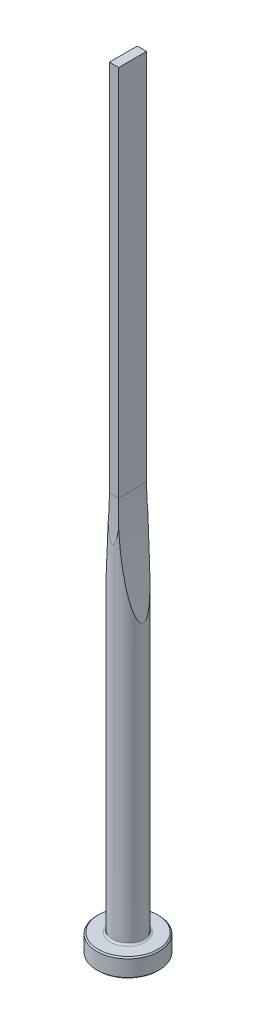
ISO-10303-21;
HEADER;
FILE_DESCRIPTION(('STEP AP214'),'2;1');
FILE_NAME('part.step','',(''),(''),'','','');
FILE_SCHEMA(('AUTOMOTIVE_DESIGN { 1 0 10303 214 1 1 1 1 }'));
ENDSEC;
DATA;
#1=APPLICATION_CONTEXT('core data for automotive mechanical design processes');
#2=APPLICATION_PROTOCOL_DEFINITION('international standard','automotive_design',2000,#1);
#3=PRODUCT_CONTEXT('',#1,'mechanical');
#4=PRODUCT('Part','Part','',(#3));
#5=PRODUCT_RELATED_PRODUCT_CATEGORY('part','',(#4));
#6=PRODUCT_DEFINITION_FORMATION('','',#4);
#7=PRODUCT_DEFINITION_CONTEXT('part definition',#1,'design');
#8=PRODUCT_DEFINITION('design','',#6,#7);
#9=PRODUCT_DEFINITION_SHAPE('','',#8);
#10=(LENGTH_UNIT() NAMED_UNIT(*) SI_UNIT(.MILLI.,.METRE.));
#11=(NAMED_UNIT(*) PLANE_ANGLE_UNIT() SI_UNIT($,.RADIAN.));
#12=(NAMED_UNIT(*) SI_UNIT($,.STERADIAN.) SOLID_ANGLE_UNIT());
#13=UNCERTAINTY_MEASURE_WITH_UNIT(LENGTH_MEASURE(1.E-05),#10,'distance_accuracy_value','');
#14=(GEOMETRIC_REPRESENTATION_CONTEXT(3) GLOBAL_UNCERTAINTY_ASSIGNED_CONTEXT((#13)) GLOBAL_UNIT_ASSIGNED_CONTEXT((#10,
#11,#12)) REPRESENTATION_CONTEXT('',''));
#15=CARTESIAN_POINT('',(0.,0.,0.));
#16=DIRECTION('',(0.,0.,1.));
#17=DIRECTION('',(1.,0.,0.));
#18=AXIS2_PLACEMENT_3D('',#15,#16,#17);
#19=CARTESIAN_POINT('',(0.,0.,0.));
#20=DIRECTION('',(0.,1.,0.));
#21=DIRECTION('',(-1.,0.,0.));
#22=AXIS2_PLACEMENT_3D('',#19,#20,#21);
#23=PLANE('',#22);
#24=CARTESIAN_POINT('',(0.,0.,0.));
#25=DIRECTION('',(0.,1.,0.));
#26=DIRECTION('',(-1.,0.,0.));
#27=AXIS2_PLACEMENT_3D('',#24,#25,#26);
#28=CIRCLE('',#27,4.8);
#29=CARTESIAN_POINT('',(-4.8,0.,0.));
#30=VERTEX_POINT('',#29);
#31=EDGE_CURVE('E133',#30,#30,#28,.T.);
#32=ORIENTED_EDGE('',*,*,#31,.F.);
#33=EDGE_LOOP('',(#32));
#34=FACE_BOUND('',#33,.T.);
#35=ADVANCED_FACE('F32',(#34),#23,.F.);
#36=CARTESIAN_POINT('',(0.,0.,0.));
#37=DIRECTION('',(0.,1.,0.));
#38=DIRECTION('',(-1.,0.,0.));
#39=AXIS2_PLACEMENT_3D('',#36,#37,#38);
#40=CONICAL_SURFACE('',#39,4.8,0.785398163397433);
#41=CARTESIAN_POINT('',(0.,0.200000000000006,0.));
#42=DIRECTION('',(0.,1.,0.));
#43=DIRECTION('',(-1.,0.,0.));
#44=AXIS2_PLACEMENT_3D('',#41,#42,#43);
#45=CIRCLE('',#44,5.);
#46=CARTESIAN_POINT('',(-5.,0.200000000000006,0.));
#47=VERTEX_POINT('',#46);
#48=EDGE_CURVE('E130',#47,#47,#45,.T.);
#49=ORIENTED_EDGE('',*,*,#48,.F.);
#50=EDGE_LOOP('',(#49));
#51=FACE_BOUND('',#50,.T.);
#52=ORIENTED_EDGE('',*,*,#31,.T.);
#53=EDGE_LOOP('',(#52));
#54=FACE_BOUND('',#53,.T.);
#55=ADVANCED_FACE('F171',(#51,#54),#40,.T.);
#56=CARTESIAN_POINT('',(0.,125.,0.));
#57=DIRECTION('',(0.,1.,0.));
#58=DIRECTION('',(-1.,0.,0.));
#59=AXIS2_PLACEMENT_3D('',#56,#57,#58);
#60=CYLINDRICAL_SURFACE('',#59,5.);
#61=CARTESIAN_POINT('',(0.,2.8,0.));
#62=DIRECTION('',(0.,1.,0.));
#63=DIRECTION('',(-1.,0.,0.));
#64=AXIS2_PLACEMENT_3D('',#61,#62,#63);
#65=CIRCLE('',#64,5.);
#66=CARTESIAN_POINT('',(-5.,2.8,0.));
#67=VERTEX_POINT('',#66);
#68=EDGE_CURVE('E127',#67,#67,#65,.T.);
#69=ORIENTED_EDGE('',*,*,#68,.F.);
#70=EDGE_LOOP('',(#69));
#71=FACE_BOUND('',#70,.T.);
#72=ORIENTED_EDGE('',*,*,#48,.T.);
#73=EDGE_LOOP('',(#72));
#74=FACE_BOUND('',#73,.T.);
#75=ADVANCED_FACE('F176',(#71,#74),#60,.T.);
#76=CARTESIAN_POINT('',(0.,2.8,0.));
#77=DIRECTION('',(0.,-1.,0.));
#78=DIRECTION('',(1.,0.,0.));
#79=AXIS2_PLACEMENT_3D('',#76,#77,#78);
#80=CONICAL_SURFACE('',#79,5.,0.785398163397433);
#81=CARTESIAN_POINT('',(0.,3.,0.));
#82=DIRECTION('',(0.,1.,0.));
#83=DIRECTION('',(-1.,0.,0.));
#84=AXIS2_PLACEMENT_3D('',#81,#82,#83);
#85=CIRCLE('',#84,4.8);
#86=CARTESIAN_POINT('',(-4.8,3.,0.));
#87=VERTEX_POINT('',#86);
#88=EDGE_CURVE('E124',#87,#87,#85,.T.);
#89=ORIENTED_EDGE('',*,*,#88,.F.);
#90=EDGE_LOOP('',(#89));
#91=FACE_BOUND('',#90,.T.);
#92=ORIENTED_EDGE('',*,*,#68,.T.);
#93=EDGE_LOOP('',(#92));
#94=FACE_BOUND('',#93,.T.);
#95=ADVANCED_FACE('F183',(#91,#94),#80,.T.);
#96=CARTESIAN_POINT('',(4.8,3.,0.));
#97=DIRECTION('',(0.,-1.,0.));
#98=DIRECTION('',(1.,0.,0.));
#99=AXIS2_PLACEMENT_3D('',#96,#97,#98);
#100=PLANE('',#99);
#101=CARTESIAN_POINT('',(0.,3.,0.));
#102=DIRECTION('',(0.,1.,0.));
#103=DIRECTION('',(-1.,0.,0.));
#104=AXIS2_PLACEMENT_3D('',#101,#102,#103);
#105=CIRCLE('',#104,2.80000000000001);
#106=CARTESIAN_POINT('',(-2.80000000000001,3.,0.));
#107=VERTEX_POINT('',#106);
#108=EDGE_CURVE('E121',#107,#107,#105,.T.);
#109=ORIENTED_EDGE('',*,*,#108,.F.);
#110=EDGE_LOOP('',(#109));
#111=FACE_BOUND('',#110,.T.);
#112=ORIENTED_EDGE('',*,*,#88,.T.);
#113=EDGE_LOOP('',(#112));
#114=FACE_BOUND('',#113,.T.);
#115=ADVANCED_FACE('F190',(#111,#114),#100,.F.);
#116=CARTESIAN_POINT('',(0.,3.3,0.));
#117=DIRECTION('',(0.,1.,0.));
#118=DIRECTION('',(-1.,0.,0.));
#119=AXIS2_PLACEMENT_3D('',#116,#117,#118);
#120=TOROIDAL_SURFACE('',#119,2.80000000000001,0.299999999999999);
#121=CARTESIAN_POINT('',(0.,3.3,0.));
#122=DIRECTION('',(0.,1.,0.));
#123=DIRECTION('',(-1.,0.,0.));
#124=AXIS2_PLACEMENT_3D('',#121,#122,#123);
#125=CIRCLE('',#124,2.50000000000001);
#126=CARTESIAN_POINT('',(-2.50000000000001,3.3,0.));
#127=VERTEX_POINT('',#126);
#128=EDGE_CURVE('E112',#127,#127,#125,.T.);
#129=ORIENTED_EDGE('',*,*,#128,.F.);
#130=EDGE_LOOP('',(#129));
#131=FACE_BOUND('',#130,.T.);
#132=ORIENTED_EDGE('',*,*,#108,.T.);
#133=EDGE_LOOP('',(#132));
#134=FACE_BOUND('',#133,.T.);
#135=ADVANCED_FACE('F168',(#131,#134),#120,.F.);
#136=CARTESIAN_POINT('',(0.,125.,0.));
#137=DIRECTION('',(0.,1.,0.));
#138=DIRECTION('',(-1.,0.,0.));
#139=AXIS2_PLACEMENT_3D('',#136,#137,#138);
#140=CYLINDRICAL_SURFACE('',#139,2.50000000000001);
#141=CARTESIAN_POINT('',(2.50000000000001,47.3382475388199,0.));
#142=CARTESIAN_POINT('',(2.49999974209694,47.3382488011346,0.0299639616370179));
#143=CARTESIAN_POINT('',(2.49945492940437,47.3409704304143,0.0599326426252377));
#144=CARTESIAN_POINT('',(2.49734508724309,47.351517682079,0.118923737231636));
#145=CARTESIAN_POINT('',(2.49577876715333,47.3593497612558,0.147944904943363));
#146=CARTESIAN_POINT('',(2.49121080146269,47.3822164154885,0.21261535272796));
#147=CARTESIAN_POINT('',(2.48792379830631,47.3986852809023,0.247729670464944));
#148=CARTESIAN_POINT('',(2.48032463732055,47.4368342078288,0.314860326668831));
#149=CARTESIAN_POINT('',(2.47601015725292,47.458526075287,0.346869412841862));
#150=CARTESIAN_POINT('',(2.46314736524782,47.5233470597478,0.431132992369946));
#151=CARTESIAN_POINT('',(2.45387010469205,47.570255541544,0.480325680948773));
#152=CARTESIAN_POINT('',(2.43420180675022,47.6701866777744,0.571697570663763));
#153=CARTESIAN_POINT('',(2.42380739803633,47.7232278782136,0.613854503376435));
#154=CARTESIAN_POINT('',(2.39667456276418,47.8624034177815,0.714096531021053));
#155=CARTESIAN_POINT('',(2.37952586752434,47.9510180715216,0.768584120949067));
#156=CARTESIAN_POINT('',(2.34463996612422,48.1328433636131,0.869175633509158));
#157=CARTESIAN_POINT('',(2.32690146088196,48.226064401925,0.915259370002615));
#158=CARTESIAN_POINT('',(2.29112604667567,48.4157610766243,1.00146229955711));
#159=CARTESIAN_POINT('',(2.27308805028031,48.5122514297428,1.04154834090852));
#160=CARTESIAN_POINT('',(2.23702945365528,48.7069387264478,1.11688630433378));
#161=CARTESIAN_POINT('',(2.21900885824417,48.805133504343,1.15214391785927));
#162=CARTESIAN_POINT('',(2.18226420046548,49.0072767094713,1.22036495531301));
#163=CARTESIAN_POINT('',(2.1635450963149,49.1112847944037,1.25315301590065));
#164=CARTESIAN_POINT('',(2.12630255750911,49.3203464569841,1.31534987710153));
#165=CARTESIAN_POINT('',(2.10777914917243,49.425400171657,1.34475822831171));
#166=CARTESIAN_POINT('',(2.05256679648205,49.7418487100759,1.4288093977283));
#167=CARTESIAN_POINT('',(2.01625464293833,49.954426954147,1.47924468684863));
#168=CARTESIAN_POINT('',(1.94480336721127,50.3820587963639,1.57198773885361));
#169=CARTESIAN_POINT('',(1.90966736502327,50.5971172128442,1.614275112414));
#170=CARTESIAN_POINT('',(1.84079713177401,51.0285523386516,1.69238726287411));
#171=CARTESIAN_POINT('',(1.80706250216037,51.2449286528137,1.72821388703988));
#172=CARTESIAN_POINT('',(1.74100855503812,51.6790490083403,1.79473825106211));
#173=CARTESIAN_POINT('',(1.70869167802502,51.896794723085,1.82542738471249));
#174=CARTESIAN_POINT('',(1.64558005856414,52.3330771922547,1.88251828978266));
#175=CARTESIAN_POINT('',(1.61478541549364,52.5516139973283,1.90891978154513));
#176=CARTESIAN_POINT('',(1.55479846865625,52.9889770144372,1.95808655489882));
#177=CARTESIAN_POINT('',(1.52560384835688,53.2078023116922,1.98085718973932));
#178=CARTESIAN_POINT('',(1.46879105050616,53.645946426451,2.02334050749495));
#179=CARTESIAN_POINT('',(1.44117284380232,53.8652652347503,2.04305324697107));
#180=CARTESIAN_POINT('',(1.36084292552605,54.5227284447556,2.09817602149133));
#181=CARTESIAN_POINT('',(1.31050324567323,54.9614924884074,2.12969084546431));
#182=CARTESIAN_POINT('',(1.21624303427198,55.8402145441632,2.18488367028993));
#183=CARTESIAN_POINT('',(1.17232299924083,56.280172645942,2.20856106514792));
#184=CARTESIAN_POINT('',(1.09093979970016,57.1610823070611,2.24987380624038));
#185=CARTESIAN_POINT('',(1.05347835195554,57.6020340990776,2.2675075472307));
#186=CARTESIAN_POINT('',(0.985053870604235,58.4846060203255,2.29805773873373));
#187=CARTESIAN_POINT('',(0.954090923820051,58.9262261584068,2.31097412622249));
#188=CARTESIAN_POINT('',(0.898630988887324,59.8107601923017,2.33309967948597));
#189=CARTESIAN_POINT('',(0.874145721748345,60.2536749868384,2.34230214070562));
#190=CARTESIAN_POINT('',(0.831724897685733,61.1398716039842,2.35769843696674));
#191=CARTESIAN_POINT('',(0.81378938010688,61.583153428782,2.36389225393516));
#192=CARTESIAN_POINT('',(0.784477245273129,62.4698869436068,2.37378057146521));
#193=CARTESIAN_POINT('',(0.77309953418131,62.9133385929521,2.37747548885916));
#194=CARTESIAN_POINT('',(0.756901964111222,63.8003809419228,2.38268159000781));
#195=CARTESIAN_POINT('',(0.752082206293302,64.2439716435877,2.38419274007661));
#196=CARTESIAN_POINT('',(0.749003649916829,65.1308026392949,2.38516164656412));
#197=CARTESIAN_POINT('',(0.75073930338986,65.5740429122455,2.38462113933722));
#198=CARTESIAN_POINT('',(0.760758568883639,66.4604353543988,2.38144371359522));
#199=CARTESIAN_POINT('',(0.769042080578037,66.9035875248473,2.37880682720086));
#200=CARTESIAN_POINT('',(0.792156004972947,67.7897658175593,2.37121007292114));
#201=CARTESIAN_POINT('',(0.806987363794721,68.2327919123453,2.36624986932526));
#202=CARTESIAN_POINT('',(0.843192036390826,69.1185365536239,2.35359207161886));
#203=CARTESIAN_POINT('',(0.864565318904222,69.5612551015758,2.34589449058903));
#204=CARTESIAN_POINT('',(0.913809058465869,70.4456067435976,2.3271542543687));
#205=CARTESIAN_POINT('',(0.941669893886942,70.8872404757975,2.31611654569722));
#206=CARTESIAN_POINT('',(1.00389211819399,71.7699234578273,2.28983487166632));
#207=CARTESIAN_POINT('',(1.03825343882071,72.2109727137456,2.27459095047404));
#208=CARTESIAN_POINT('',(1.11344668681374,73.0922077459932,2.23874335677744));
#209=CARTESIAN_POINT('',(1.15427720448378,73.5323936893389,2.2181408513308));
#210=CARTESIAN_POINT('',(1.24237727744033,74.4117313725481,2.17003044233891));
#211=CARTESIAN_POINT('',(1.28964643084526,74.8508831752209,2.14252296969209));
#212=CARTESIAN_POINT('',(1.36514966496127,75.5069756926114,2.0945731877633));
#213=CARTESIAN_POINT('',(1.39098157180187,75.7244460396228,2.07754923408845));
#214=CARTESIAN_POINT('',(1.44420470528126,76.1589800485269,2.04091149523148));
#215=CARTESIAN_POINT('',(1.47159593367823,76.3760437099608,2.02129770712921));
#216=CARTESIAN_POINT('',(1.52793970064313,76.8098188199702,1.97905052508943));
#217=CARTESIAN_POINT('',(1.55689322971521,77.0265299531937,1.95641520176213));
#218=CARTESIAN_POINT('',(1.61632244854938,77.459343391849,1.9076114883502));
#219=CARTESIAN_POINT('',(1.64679810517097,77.6754457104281,1.88144317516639));
#220=CARTESIAN_POINT('',(1.70918811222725,78.1065315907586,1.82495082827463));
#221=CARTESIAN_POINT('',(1.74109999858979,78.3215164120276,1.79463374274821));
#222=CARTESIAN_POINT('',(1.80636001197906,78.7504896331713,1.72893369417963));
#223=CARTESIAN_POINT('',(1.83970806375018,78.9644780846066,1.6935509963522));
#224=CARTESIAN_POINT('',(1.90773443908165,79.3909147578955,1.61653581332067));
#225=CARTESIAN_POINT('',(1.9424115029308,79.6033642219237,1.57490914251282));
#226=CARTESIAN_POINT('',(2.01299593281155,80.0263109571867,1.48364476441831));
#227=CARTESIAN_POINT('',(2.0489029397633,80.2368087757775,1.43400937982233));
#228=CARTESIAN_POINT('',(2.10356476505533,80.5505901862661,1.35133144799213));
#229=CARTESIAN_POINT('',(2.12194676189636,80.6550097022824,1.32235225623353));
#230=CARTESIAN_POINT('',(2.15891519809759,80.8628758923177,1.26109909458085));
#231=CARTESIAN_POINT('',(2.17750168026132,80.9663223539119,1.22882442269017));
#232=CARTESIAN_POINT('',(2.21472651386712,81.1714617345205,1.16038706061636));
#233=CARTESIAN_POINT('',(2.23336438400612,81.2731599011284,1.12423994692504));
#234=CARTESIAN_POINT('',(2.27063774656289,81.4746146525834,1.04692674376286));
#235=CARTESIAN_POINT('',(2.2892732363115,81.5743720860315,1.00576290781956));
#236=CARTESIAN_POINT('',(2.32118376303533,81.7436461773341,0.929145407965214));
#237=CARTESIAN_POINT('',(2.33451045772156,81.8138685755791,0.895279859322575));
#238=CARTESIAN_POINT('',(2.36098921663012,81.9525150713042,0.822941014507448));
#239=CARTESIAN_POINT('',(2.37413983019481,82.0209264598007,0.784442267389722));
#240=CARTESIAN_POINT('',(2.39524086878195,82.1300442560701,0.716644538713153));
#241=CARTESIAN_POINT('',(2.40334612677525,82.1717931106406,0.689078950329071));
#242=CARTESIAN_POINT('',(2.41922653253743,82.2532946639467,0.631069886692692));
#243=CARTESIAN_POINT('',(2.42700189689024,82.2930486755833,0.600628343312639));
#244=CARTESIAN_POINT('',(2.44198697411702,82.369408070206,0.536450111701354));
#245=CARTESIAN_POINT('',(2.44920067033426,82.4060358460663,0.502741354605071));
#246=CARTESIAN_POINT('',(2.46282096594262,82.4749890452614,0.431091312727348));
#247=CARTESIAN_POINT('',(2.46922995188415,82.5073272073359,0.393163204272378));
#248=CARTESIAN_POINT('',(2.47874666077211,82.5552331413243,0.326373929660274));
#249=CARTESIAN_POINT('',(2.48222668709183,82.5727188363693,0.29895642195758));
#250=CARTESIAN_POINT('',(2.48843384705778,82.6038686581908,0.241907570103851));
#251=CARTESIAN_POINT('',(2.49116114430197,82.617533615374,0.212276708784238));
#252=CARTESIAN_POINT('',(2.49564729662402,82.6399933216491,0.150685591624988));
#253=CARTESIAN_POINT('',(2.49739396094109,82.648726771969,0.118701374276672));
#254=CARTESIAN_POINT('',(2.49963581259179,82.6599336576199,0.053616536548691));
#255=CARTESIAN_POINT('',(2.5001329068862,82.6624166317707,0.0205176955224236));
#256=CARTESIAN_POINT('',(2.49982342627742,82.6608701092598,-0.041729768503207));
#257=CARTESIAN_POINT('',(2.49915875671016,82.6575495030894,-0.07089932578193));
#258=CARTESIAN_POINT('',(2.49687373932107,82.646125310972,-0.128247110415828));
#259=CARTESIAN_POINT('',(2.49525246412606,82.638017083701,-0.156424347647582));
#260=CARTESIAN_POINT('',(2.49052227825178,82.6143344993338,-0.220589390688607));
#261=CARTESIAN_POINT('',(2.48709425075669,82.5971552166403,-0.255953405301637));
#262=CARTESIAN_POINT('',(2.47921596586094,82.5575937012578,-0.323497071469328));
#263=CARTESIAN_POINT('',(2.47476326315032,82.5351990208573,-0.355668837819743));
#264=CARTESIAN_POINT('',(2.46140541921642,82.4678553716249,-0.441105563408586));
#265=CARTESIAN_POINT('',(2.45174732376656,82.4189932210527,-0.491122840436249));
#266=CARTESIAN_POINT('',(2.43131462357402,82.3150994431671,-0.58391480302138));
#267=CARTESIAN_POINT('',(2.42053657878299,82.2600487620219,-0.626666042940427));
#268=CARTESIAN_POINT('',(2.39220322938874,82.1145507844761,-0.729097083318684));
#269=CARTESIAN_POINT('',(2.37422257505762,82.0214952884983,-0.784909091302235));
#270=CARTESIAN_POINT('',(2.33768776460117,81.8307033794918,-0.88778357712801));
#271=CARTESIAN_POINT('',(2.31913233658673,81.7329562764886,-0.934824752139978));
#272=CARTESIAN_POINT('',(2.28174701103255,81.5341613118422,-1.02270155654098));
#273=CARTESIAN_POINT('',(2.26291618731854,81.4330989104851,-1.06350358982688));
#274=CARTESIAN_POINT('',(2.22530373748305,81.2292603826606,-1.14010298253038));
#275=CARTESIAN_POINT('',(2.20652207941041,81.1264864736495,-1.17590632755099));
#276=CARTESIAN_POINT('',(2.16796672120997,80.9133843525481,-1.24563309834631));
#277=CARTESIAN_POINT('',(2.14820170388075,80.8029751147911,-1.27931195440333));
#278=CARTESIAN_POINT('',(2.1089109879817,80.5810797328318,-1.34308990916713));
#279=CARTESIAN_POINT('',(2.08938532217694,80.469593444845,-1.37318852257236));
#280=CARTESIAN_POINT('',(2.0312342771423,80.1338097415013,-1.45907642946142));
#281=CARTESIAN_POINT('',(1.99305498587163,79.9082986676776,-1.51042296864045));
#282=CARTESIAN_POINT('',(1.918058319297,79.4547277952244,-1.60457182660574));
#283=CARTESIAN_POINT('',(1.8812445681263,79.2266630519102,-1.64735257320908));
#284=CARTESIAN_POINT('',(1.80921725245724,78.7691961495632,-1.72614584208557));
#285=CARTESIAN_POINT('',(1.77400322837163,78.5397943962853,-1.76216031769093));
#286=CARTESIAN_POINT('',(1.70517030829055,78.0794720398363,-1.82884949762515));
#287=CARTESIAN_POINT('',(1.67155501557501,77.8485492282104,-1.85951252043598));
#288=CARTESIAN_POINT('',(1.60604860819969,77.385900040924,-1.9163734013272));
#289=CARTESIAN_POINT('',(1.57415760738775,77.1541736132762,-1.94257096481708));
#290=CARTESIAN_POINT('',(1.51218248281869,76.6904475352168,-1.99119375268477));
#291=CARTESIAN_POINT('',(1.48209570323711,76.4584488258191,-2.01362461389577));
#292=CARTESIAN_POINT('',(1.42370026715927,75.9939516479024,-2.05532485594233));
#293=CARTESIAN_POINT('',(1.39539157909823,75.7614531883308,-2.07459429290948));
#294=CARTESIAN_POINT('',(1.3131487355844,75.0632640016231,-2.12837009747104));
#295=CARTESIAN_POINT('',(1.26190609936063,74.5969415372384,-2.15883771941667));
#296=CARTESIAN_POINT('',(1.16667979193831,73.6630871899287,-2.21174240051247));
#297=CARTESIAN_POINT('',(1.12269667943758,73.1955552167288,-2.23417884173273));
#298=CARTESIAN_POINT('',(1.04202589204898,72.2594850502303,-2.27292401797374));
#299=CARTESIAN_POINT('',(1.00534020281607,71.7909466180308,-2.28923108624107));
#300=CARTESIAN_POINT('',(0.939305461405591,70.8532112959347,-2.31710729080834));
#301=CARTESIAN_POINT('',(0.909956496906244,70.3840143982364,-2.32867637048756));
#302=CARTESIAN_POINT('',(0.858559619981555,69.4441951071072,-2.348112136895));
#303=CARTESIAN_POINT('',(0.83652657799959,68.9735717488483,-2.35597129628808));
#304=CARTESIAN_POINT('',(0.799852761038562,68.0319948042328,-2.36867288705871));
#305=CARTESIAN_POINT('',(0.785212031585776,67.5610412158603,-2.37351529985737));
#306=CARTESIAN_POINT('',(0.763330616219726,66.6190301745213,-2.38064242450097));
#307=CARTESIAN_POINT('',(0.756088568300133,66.147972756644,-2.38292760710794));
#308=CARTESIAN_POINT('',(0.749002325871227,65.205798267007,-2.38516440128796));
#309=CARTESIAN_POINT('',(0.749158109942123,64.734681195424,-2.38511601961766));
#310=CARTESIAN_POINT('',(0.756853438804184,63.7942225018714,-2.38268527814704));
#311=CARTESIAN_POINT('',(0.764366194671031,63.3248806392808,-2.38031138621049));
#312=CARTESIAN_POINT('',(0.786733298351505,62.3863892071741,-2.37301275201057));
#313=CARTESIAN_POINT('',(0.80158767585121,61.9172396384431,-2.36808799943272));
#314=CARTESIAN_POINT('',(0.838637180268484,60.9791496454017,-2.35522253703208));
#315=CARTESIAN_POINT('',(0.86083419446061,60.5102093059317,-2.34728105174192));
#316=CARTESIAN_POINT('',(0.91255792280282,59.5728143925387,-2.32766070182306));
#317=CARTESIAN_POINT('',(0.942084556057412,59.1043598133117,-2.31598187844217));
#318=CARTESIAN_POINT('',(1.00838950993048,58.1689855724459,-2.28789158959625));
#319=CARTESIAN_POINT('',(1.04515412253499,57.7020646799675,-2.27148904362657));
#320=CARTESIAN_POINT('',(1.12594221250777,56.769113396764,-2.2325470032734));
#321=CARTESIAN_POINT('',(1.16996553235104,56.3030829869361,-2.21000764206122));
#322=CARTESIAN_POINT('',(1.26520845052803,55.3723956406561,-2.15690518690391));
#323=CARTESIAN_POINT('',(1.3164249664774,54.9077382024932,-2.12634552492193));
#324=CARTESIAN_POINT('',(1.39859035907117,54.212037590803,-2.07243915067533));
#325=CARTESIAN_POINT('',(1.42686749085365,53.9803623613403,-2.05312696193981));
#326=CARTESIAN_POINT('',(1.4851857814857,53.5175203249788,-2.01134664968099));
#327=CARTESIAN_POINT('',(1.51522689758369,53.286353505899,-1.9888786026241));
#328=CARTESIAN_POINT('',(1.56799035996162,52.8923053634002,-1.94735133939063));
#329=CARTESIAN_POINT('',(1.59027725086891,52.7292674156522,-1.92922300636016));
#330=CARTESIAN_POINT('',(1.63571117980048,52.4035494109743,-1.89085534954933));
#331=CARTESIAN_POINT('',(1.65885826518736,52.2408693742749,-1.87061590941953));
#332=CARTESIAN_POINT('',(1.70598789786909,51.9160083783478,-1.82773646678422));
#333=CARTESIAN_POINT('',(1.72997013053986,51.7538272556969,-1.80509736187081));
#334=CARTESIAN_POINT('',(1.77875723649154,51.4300047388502,-1.75704135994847));
#335=CARTESIAN_POINT('',(1.80356208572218,51.2683633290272,-1.73162454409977));
#336=CARTESIAN_POINT('',(1.86330894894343,50.8859565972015,-1.66752965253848));
#337=CARTESIAN_POINT('',(1.89860089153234,50.6654812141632,-1.62742787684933));
#338=CARTESIAN_POINT('',(1.97058347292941,50.2262152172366,-1.53949687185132));
#339=CARTESIAN_POINT('',(2.00727444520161,50.0074250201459,-1.49166579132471));
#340=CARTESIAN_POINT('',(2.07032920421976,49.6396855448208,-1.40204474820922));
#341=CARTESIAN_POINT('',(2.09638379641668,49.4900298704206,-1.36294933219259));
#342=CARTESIAN_POINT('',(2.14892380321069,49.1926582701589,-1.27852059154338));
#343=CARTESIAN_POINT('',(2.17540887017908,49.0449409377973,-1.2331920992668));
#344=CARTESIAN_POINT('',(2.2205883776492,48.7964798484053,-1.14913893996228));
#345=CARTESIAN_POINT('',(2.23922250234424,48.6950098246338,-1.11254783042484));
#346=CARTESIAN_POINT('',(2.27650756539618,48.4938914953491,-1.03411981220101));
#347=CARTESIAN_POINT('',(2.29515847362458,48.3942467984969,-0.992273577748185));
#348=CARTESIAN_POINT('',(2.33340726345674,48.1917475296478,-0.898861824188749));
#349=CARTESIAN_POINT('',(2.35299046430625,48.0890883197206,-0.846849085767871));
#350=CARTESIAN_POINT('',(2.38169709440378,47.9399408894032,-0.760538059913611));
#351=CARTESIAN_POINT('',(2.39114177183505,47.8910973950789,-0.730433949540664));
#352=CARTESIAN_POINT('',(2.40967354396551,47.7956670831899,-0.666767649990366));
#353=CARTESIAN_POINT('',(2.418760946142,47.7490783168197,-0.633208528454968));
#354=CARTESIAN_POINT('',(2.43460713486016,47.6681584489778,-0.568820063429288));
#355=CARTESIAN_POINT('',(2.44146983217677,47.6332311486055,-0.538773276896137));
#356=CARTESIAN_POINT('',(2.45464081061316,47.566391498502,-0.475179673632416));
#357=CARTESIAN_POINT('',(2.46094786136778,47.5344858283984,-0.441625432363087));
#358=CARTESIAN_POINT('',(2.47276187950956,47.4748705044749,-0.369860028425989));
#359=CARTESIAN_POINT('',(2.47825506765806,47.4472328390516,-0.331585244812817));
#360=CARTESIAN_POINT('',(2.48775516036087,47.3995247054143,-0.250430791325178));
#361=CARTESIAN_POINT('',(2.49176985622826,47.3794145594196,-0.207576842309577));
#362=CARTESIAN_POINT('',(2.49640282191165,47.3562287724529,-0.136623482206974));
#363=CARTESIAN_POINT('',(2.49773907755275,47.3495478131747,-0.109751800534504));
#364=CARTESIAN_POINT('',(2.49953747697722,47.3405581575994,-0.0552543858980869));
#365=CARTESIAN_POINT('',(2.50000023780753,47.3382463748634,-0.0276291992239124));
#366=CARTESIAN_POINT('',(2.50000000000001,47.3382475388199,0.));
#367=B_SPLINE_CURVE_WITH_KNOTS('',3,(#141,#142,#143,#144,#145,#146,#147,#148,#149,#150,#151,
#152,#153,#154,#155,#156,#157,#158,#159,#160,#161,#162,#163,#164,#165,#166,#167,#168,#169,#170,
#171,#172,#173,#174,#175,#176,#177,#178,#179,#180,#181,#182,#183,#184,#185,#186,#187,#188,#189,
#190,#191,#192,#193,#194,#195,#196,#197,#198,#199,#200,#201,#202,#203,#204,#205,#206,#207,#208,
#209,#210,#211,#212,#213,#214,#215,#216,#217,#218,#219,#220,#221,#222,#223,#224,#225,#226,#227,
#228,#229,#230,#231,#232,#233,#234,#235,#236,#237,#238,#239,#240,#241,#242,#243,#244,#245,#246,
#247,#248,#249,#250,#251,#252,#253,#254,#255,#256,#257,#258,#259,#260,#261,#262,#263,#264,#265,
#266,#267,#268,#269,#270,#271,#272,#273,#274,#275,#276,#277,#278,#279,#280,#281,#282,#283,#284,
#285,#286,#287,#288,#289,#290,#291,#292,#293,#294,#295,#296,#297,#298,#299,#300,#301,#302,#303,
#304,#305,#306,#307,#308,#309,#310,#311,#312,#313,#314,#315,#316,#317,#318,#319,#320,#321,#322,
#323,#324,#325,#326,#327,#328,#329,#330,#331,#332,#333,#334,#335,#336,#337,#338,#339,#340,#341,
#342,#343,#344,#345,#346,#347,#348,#349,#350,#351,#352,#353,#354,#355,#356,#357,#358,#359,#360,
#361,#362,#363,#364,#365,#366),.UNSPECIFIED.,.T.,.F.,(4,2,2,2,2,2,2,2,2,2,2,2,2,2,2,2,2,2,2,2,2,
2,2,2,2,2,2,2,2,2,2,2,2,2,2,2,2,2,2,2,2,2,2,2,2,2,2,2,2,2,2,2,2,2,2,2,2,2,2,2,2,2,2,2,2,2,2,2,2,
2,2,2,2,2,2,2,2,2,2,2,2,2,2,2,2,2,2,2,2,2,2,2,2,2,2,2,2,2,2,2,2,2,2,2,2,2,2,2,2,2,2,2,4),(0.,
0.0897803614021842,0.179674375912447,0.295781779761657,0.412154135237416,0.616804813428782,
0.822091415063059,1.1375761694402,1.4538090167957,1.77172990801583,2.08927276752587,
2.42114730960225,2.75306593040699,3.41723541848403,4.08304593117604,4.74866577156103,
5.41538972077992,6.08215713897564,6.74793221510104,7.4136949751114,8.74183269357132,
10.07007308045,11.3986659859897,12.7272766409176,14.0582751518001,15.3892816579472,
16.7200660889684,18.0508710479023,19.3805499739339,20.7102085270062,22.0400592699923,
23.3699036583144,24.6977881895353,26.0256587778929,27.353240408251,28.680739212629,
29.3397018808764,29.9986652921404,30.6580515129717,31.3174233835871,31.9757041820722,
32.6339505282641,33.2915876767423,33.9490344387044,34.2787363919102,34.6085087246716,
34.9370011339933,35.2653465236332,35.5025221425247,35.7410657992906,35.8930185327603,
36.044869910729,36.1955216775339,36.345715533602,36.4435924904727,36.5414481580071,
36.6404948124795,36.7393902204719,36.8270325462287,36.9147599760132,37.0324847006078,
37.1504933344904,37.3610616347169,37.5722969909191,37.9014204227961,38.2313331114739,
38.562964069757,38.8941944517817,39.2454528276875,39.5967587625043,40.2997248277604,
41.0044395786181,41.7089505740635,42.4149806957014,43.1210573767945,43.826067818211,
44.5310657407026,45.941250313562,47.3515433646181,48.7622196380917,50.1729127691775,
51.5864559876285,53.0000079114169,54.4132995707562,55.8265871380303,57.2347475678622,
58.6429136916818,60.0514420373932,61.4599548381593,62.8658252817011,64.2716652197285,
65.6769045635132,66.3794590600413,67.0819965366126,67.5786321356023,68.0752951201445,
68.5717729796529,69.0682363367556,69.7486949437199,70.4293167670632,70.8997916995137,
71.3699039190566,71.6981832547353,72.0270536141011,72.3767163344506,72.5510571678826,
72.7252445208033,72.8648209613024,73.0046990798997,73.1467259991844,73.2879933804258,
73.3708366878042,73.4536214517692),.UNSPECIFIED.);
#368=CARTESIAN_POINT('',(0.850781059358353,60.7420152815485,-2.35078105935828));
#369=VERTEX_POINT('',#368);
#370=CARTESIAN_POINT('',(0.850781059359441,60.7420152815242,2.35078105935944));
#371=VERTEX_POINT('',#370);
#372=EDGE_CURVE('E138',#369,#371,#367,.T.);
#373=ORIENTED_EDGE('',*,*,#372,.T.);
#374=CARTESIAN_POINT('',(-1.08972473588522,65.,2.24999999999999));
#375=CARTESIAN_POINT('',(-1.08973017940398,65.417843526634,2.25000007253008));
#376=CARTESIAN_POINT('',(-1.08376950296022,65.8356940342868,2.25291055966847));
#377=CARTESIAN_POINT('',(-1.05925903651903,66.6712267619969,2.2645476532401));
#378=CARTESIAN_POINT('',(-1.04070157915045,67.0889087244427,2.27327780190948));
#379=CARTESIAN_POINT('',(-1.00139602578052,67.7150755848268,2.29071964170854));
#380=CARTESIAN_POINT('',(-0.986358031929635,67.9239852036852,2.29726834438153));
#381=CARTESIAN_POINT('',(-0.951794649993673,68.3413786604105,2.31180577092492));
#382=CARTESIAN_POINT('',(-0.932269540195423,68.5498625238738,2.31979440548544));
#383=CARTESIAN_POINT('',(-0.88777075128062,68.9659737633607,2.33718458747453));
#384=CARTESIAN_POINT('',(-0.862802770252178,69.1736018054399,2.34658465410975));
#385=CARTESIAN_POINT('',(-0.805815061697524,69.5878049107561,2.36677025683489));
#386=CARTESIAN_POINT('',(-0.773797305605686,69.7943802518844,2.37755540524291));
#387=CARTESIAN_POINT('',(-0.718068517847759,70.1031004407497,2.39473279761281));
#388=CARTESIAN_POINT('',(-0.698175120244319,70.2059606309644,2.40063421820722));
#389=CARTESIAN_POINT('',(-0.655081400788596,70.4110633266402,2.41275302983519));
#390=CARTESIAN_POINT('',(-0.631878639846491,70.5133053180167,2.41897065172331));
#391=CARTESIAN_POINT('',(-0.581182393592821,70.7160803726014,2.43164611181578));
#392=CARTESIAN_POINT('',(-0.55371434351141,70.8166198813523,2.43810236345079));
#393=CARTESIAN_POINT('',(-0.492483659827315,71.0157234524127,2.45121963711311));
#394=CARTESIAN_POINT('',(-0.458730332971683,71.1142901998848,2.45788034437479));
#395=CARTESIAN_POINT('',(-0.406261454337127,71.2433039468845,2.46680425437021));
#396=CARTESIAN_POINT('',(-0.392361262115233,71.2756958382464,2.46906284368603));
#397=CARTESIAN_POINT('',(-0.36288871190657,71.3398145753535,2.47356778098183));
#398=CARTESIAN_POINT('',(-0.347312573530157,71.3715397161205,2.47581408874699));
#399=CARTESIAN_POINT('',(-0.312495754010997,71.436683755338,2.48046026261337));
#400=CARTESIAN_POINT('',(-0.293050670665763,71.4699944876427,2.48285552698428));
#401=CARTESIAN_POINT('',(-0.250541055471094,71.5342134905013,2.48750743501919));
#402=CARTESIAN_POINT('',(-0.227491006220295,71.5651306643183,2.4897645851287));
#403=CARTESIAN_POINT('',(-0.191076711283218,71.605216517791,2.4927091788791));
#404=CARTESIAN_POINT('',(-0.180024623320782,71.6164519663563,2.49353684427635));
#405=CARTESIAN_POINT('',(-0.156763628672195,71.6377261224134,2.49510762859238));
#406=CARTESIAN_POINT('',(-0.144552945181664,71.6477629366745,2.49585061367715));
#407=CARTESIAN_POINT('',(-0.11863468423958,71.6661965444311,2.49721781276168));
#408=CARTESIAN_POINT('',(-0.104907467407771,71.6745665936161,2.49784008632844));
#409=CARTESIAN_POINT('',(-0.076116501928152,71.6885607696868,2.49888187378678));
#410=CARTESIAN_POINT('',(-0.0610589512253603,71.6941969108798,2.49930227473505));
#411=CARTESIAN_POINT('',(-0.0351108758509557,71.7005354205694,2.49977531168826));
#412=CARTESIAN_POINT('',(-0.0244691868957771,71.7022487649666,2.49990327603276));
#413=CARTESIAN_POINT('',(-0.00304761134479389,71.7038251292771,2.50002100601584));
#414=CARTESIAN_POINT('',(0.00773220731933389,71.7036890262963,2.5000108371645));
#415=CARTESIAN_POINT('',(0.0290836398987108,71.7015838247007,2.49985362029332));
#416=CARTESIAN_POINT('',(0.0396556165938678,71.6996182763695,2.49970683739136));
#417=CARTESIAN_POINT('',(0.0603614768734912,71.6940683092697,2.49929272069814));
#418=CARTESIAN_POINT('',(0.0704949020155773,71.6904822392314,2.49902526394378));
#419=CARTESIAN_POINT('',(0.0952035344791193,71.6798195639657,2.49823093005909));
#420=CARTESIAN_POINT('',(0.109407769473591,71.6718955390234,2.49764131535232));
#421=CARTESIAN_POINT('',(0.136432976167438,71.6539792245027,2.49631126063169));
#422=CARTESIAN_POINT('',(0.149249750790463,71.6439809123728,2.49557038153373));
#423=CARTESIAN_POINT('',(0.184823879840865,71.6128486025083,2.4932696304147));
#424=CARTESIAN_POINT('',(0.205953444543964,71.5898925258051,2.49158038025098));
#425=CARTESIAN_POINT('',(0.245040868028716,71.5414729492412,2.48803849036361));
#426=CARTESIAN_POINT('',(0.262988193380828,71.5160015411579,2.48618533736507));
#427=CARTESIAN_POINT('',(0.309251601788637,71.4439736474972,2.48097806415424));
#428=CARTESIAN_POINT('',(0.335237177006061,71.3959431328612,2.47754152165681));
#429=CARTESIAN_POINT('',(0.382999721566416,71.2978052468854,2.47060314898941));
#430=CARTESIAN_POINT('',(0.404765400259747,71.2476927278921,2.4671011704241));
#431=CARTESIAN_POINT('',(0.445440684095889,71.1460163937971,2.46008358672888));
#432=CARTESIAN_POINT('',(0.464334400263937,71.0944462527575,2.45656800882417));
#433=CARTESIAN_POINT('',(0.499871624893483,70.9906273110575,2.44958188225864));
#434=CARTESIAN_POINT('',(0.516518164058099,70.9383795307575,2.44611127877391));
#435=CARTESIAN_POINT('',(0.570055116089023,70.7604659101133,2.43445124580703));
#436=CARTESIAN_POINT('',(0.602958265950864,70.6335961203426,2.42640128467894));
#437=CARTESIAN_POINT('',(0.662697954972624,70.3783895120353,2.41075844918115));
#438=CARTESIAN_POINT('',(0.68953031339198,70.2500517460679,2.40316589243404));
#439=CARTESIAN_POINT('',(0.738831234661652,69.9922233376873,2.3884709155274));
#440=CARTESIAN_POINT('',(0.761290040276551,69.8627307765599,2.38136961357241));
#441=CARTESIAN_POINT('',(0.802785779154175,69.6031659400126,2.36770048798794));
#442=CARTESIAN_POINT('',(0.821822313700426,69.4730935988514,2.36113272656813));
#443=CARTESIAN_POINT('',(0.874789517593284,69.0823835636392,2.34225784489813));
#444=CARTESIAN_POINT('',(0.90459676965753,68.8211467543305,2.33077307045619));
#445=CARTESIAN_POINT('',(0.95619540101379,68.2981762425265,2.31007303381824));
#446=CARTESIAN_POINT('',(0.977997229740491,68.036443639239,2.30085481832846));
#447=CARTESIAN_POINT('',(1.01364418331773,67.5340508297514,2.28536011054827));
#448=CARTESIAN_POINT('',(1.02799698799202,67.2934317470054,2.27890378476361));
#449=CARTESIAN_POINT('',(1.05200468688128,66.811910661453,2.2679185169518));
#450=CARTESIAN_POINT('',(1.0616593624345,66.5710086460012,2.26338966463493));
#451=CARTESIAN_POINT('',(1.08427569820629,65.8477062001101,2.25269986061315));
#452=CARTESIAN_POINT('',(1.09086681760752,65.3650527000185,2.24944626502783));
#453=CARTESIAN_POINT('',(1.08826743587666,64.4005215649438,2.25070638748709));
#454=CARTESIAN_POINT('',(1.07910067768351,63.9186438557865,2.25520841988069));
#455=CARTESIAN_POINT('',(1.05232994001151,63.1965993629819,2.26774808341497));
#456=CARTESIAN_POINT('',(1.04124239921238,62.9561303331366,2.27288960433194));
#457=CARTESIAN_POINT('',(1.01419155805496,62.4755202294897,2.28509144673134));
#458=CARTESIAN_POINT('',(0.998228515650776,62.2353791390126,2.29215166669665));
#459=CARTESIAN_POINT('',(0.960610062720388,61.7558420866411,2.30816912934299));
#460=CARTESIAN_POINT('',(0.938960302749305,61.516445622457,2.31712448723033));
#461=CARTESIAN_POINT('',(0.888559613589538,61.0381620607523,2.33692439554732));
#462=CARTESIAN_POINT('',(0.859800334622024,60.799275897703,2.34777116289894));
#463=CARTESIAN_POINT('',(0.809334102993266,60.4415432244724,2.36543615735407));
#464=CARTESIAN_POINT('',(0.791245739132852,60.3221520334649,2.37157111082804));
#465=CARTESIAN_POINT('',(0.752062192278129,60.0838917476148,2.3842885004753));
#466=CARTESIAN_POINT('',(0.730967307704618,59.9650226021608,2.39087089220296));
#467=CARTESIAN_POINT('',(0.684984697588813,59.7283066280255,2.40444765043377));
#468=CARTESIAN_POINT('',(0.660105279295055,59.6104581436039,2.41144109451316));
#469=CARTESIAN_POINT('',(0.60518821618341,59.3760080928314,2.42581353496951));
#470=CARTESIAN_POINT('',(0.575153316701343,59.2594058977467,2.43319232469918));
#471=CARTESIAN_POINT('',(0.524064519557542,59.0857489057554,2.44451548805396));
#472=CARTESIAN_POINT('',(0.505939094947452,59.027828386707,2.44834915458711));
#473=CARTESIAN_POINT('',(0.466994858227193,58.9127359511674,2.45607737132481));
#474=CARTESIAN_POINT('',(0.446170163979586,58.855565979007,2.45997203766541));
#475=CARTESIAN_POINT('',(0.400982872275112,58.7431082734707,2.46773856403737));
#476=CARTESIAN_POINT('',(0.376646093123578,58.6878101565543,2.47161039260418));
#477=CARTESIAN_POINT('',(0.322567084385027,58.5799691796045,2.47925828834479));
#478=CARTESIAN_POINT('',(0.292848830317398,58.5274153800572,2.4830346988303));
#479=CARTESIAN_POINT('',(0.240881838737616,58.453178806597,2.48842819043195));
#480=CARTESIAN_POINT('',(0.222183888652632,58.4290596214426,2.4901912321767));
#481=CARTESIAN_POINT('',(0.181321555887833,58.3840125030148,2.49350050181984));
#482=CARTESIAN_POINT('',(0.159186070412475,58.3630606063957,2.49504834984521));
#483=CARTESIAN_POINT('',(0.124664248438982,58.3379562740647,2.49690963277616));
#484=CARTESIAN_POINT('',(0.11422137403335,58.3311807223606,2.49741292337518));
#485=CARTESIAN_POINT('',(0.0924948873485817,58.3190904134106,2.49831208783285));
#486=CARTESIAN_POINT('',(0.0812111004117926,58.313775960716,2.49870793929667));
#487=CARTESIAN_POINT('',(0.0577522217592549,58.3050206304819,2.49936060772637));
#488=CARTESIAN_POINT('',(0.0455677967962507,58.3016038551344,2.49961563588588));
#489=CARTESIAN_POINT('',(0.0207704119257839,58.297201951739,2.4999442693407));
#490=CARTESIAN_POINT('',(0.0081583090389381,58.2962122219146,2.50001821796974));
#491=CARTESIAN_POINT('',(-0.0155552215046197,58.296770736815,2.49997650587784));
#492=CARTESIAN_POINT('',(-0.0266642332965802,58.298041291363,2.49988159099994));
#493=CARTESIAN_POINT('',(-0.0485078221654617,58.302439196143,2.49955329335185));
#494=CARTESIAN_POINT('',(-0.059241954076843,58.3055686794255,2.49931975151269));
#495=CARTESIAN_POINT('',(-0.0837875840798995,58.3147484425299,2.49863544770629));
#496=CARTESIAN_POINT('',(-0.0973551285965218,58.3214386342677,2.49813719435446));
#497=CARTESIAN_POINT('',(-0.123276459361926,58.3368383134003,2.49699260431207));
#498=CARTESIAN_POINT('',(-0.135627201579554,58.3455526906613,2.4963459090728));
#499=CARTESIAN_POINT('',(-0.168932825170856,58.3721120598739,2.49437960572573));
#500=CARTESIAN_POINT('',(-0.188583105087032,58.3915600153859,2.49294489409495));
#501=CARTESIAN_POINT('',(-0.225097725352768,58.4328745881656,2.48991253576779));
#502=CARTESIAN_POINT('',(-0.241952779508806,58.4547488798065,2.48831437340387));
#503=CARTESIAN_POINT('',(-0.283874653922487,58.5145295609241,2.48397048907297));
#504=CARTESIAN_POINT('',(-0.307190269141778,58.5536442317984,2.48115187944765));
#505=CARTESIAN_POINT('',(-0.350288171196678,58.6337968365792,2.47543182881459));
#506=CARTESIAN_POINT('',(-0.370061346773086,58.6748393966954,2.47253019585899));
#507=CARTESIAN_POINT('',(-0.407174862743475,58.7582740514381,2.46669078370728));
#508=CARTESIAN_POINT('',(-0.424501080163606,58.8006723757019,2.46375289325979));
#509=CARTESIAN_POINT('',(-0.457204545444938,58.8861386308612,2.45789268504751));
#510=CARTESIAN_POINT('',(-0.472584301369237,58.9292056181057,2.45497035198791));
#511=CARTESIAN_POINT('',(-0.521348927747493,59.0734883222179,2.44528588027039));
#512=CARTESIAN_POINT('',(-0.551455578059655,59.1758119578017,2.43858951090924));
#513=CARTESIAN_POINT('',(-0.606551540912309,59.3818614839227,2.42546430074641));
#514=CARTESIAN_POINT('',(-0.631537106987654,59.4855883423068,2.4190356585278));
#515=CARTESIAN_POINT('',(-0.677824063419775,59.6941236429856,2.40647709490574));
#516=CARTESIAN_POINT('',(-0.699116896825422,59.7989340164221,2.40034789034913));
#517=CARTESIAN_POINT('',(-0.738809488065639,60.0091243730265,2.38842728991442));
#518=CARTESIAN_POINT('',(-0.757208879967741,60.1145044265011,2.38263593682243));
#519=CARTESIAN_POINT('',(-0.80891692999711,60.431153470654,2.36579508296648));
#520=CARTESIAN_POINT('',(-0.838753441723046,60.6430174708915,2.35527359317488));
#521=CARTESIAN_POINT('',(-0.891753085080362,61.0673268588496,2.33571214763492));
#522=CARTESIAN_POINT('',(-0.91492499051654,61.279771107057,2.3266702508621));
#523=CARTESIAN_POINT('',(-0.963653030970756,61.7837885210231,2.30701281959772));
#524=CARTESIAN_POINT('',(-0.986928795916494,62.075607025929,2.29704951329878));
#525=CARTESIAN_POINT('',(-1.02579741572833,62.6599618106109,2.27995094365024));
#526=CARTESIAN_POINT('',(-1.04138647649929,62.9524983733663,2.2728170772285));
#527=CARTESIAN_POINT('',(-1.06593128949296,63.5374527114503,2.26140963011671));
#528=CARTESIAN_POINT('',(-1.0748971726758,63.8298699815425,2.25713168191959));
#529=CARTESIAN_POINT('',(-1.08679206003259,64.4148570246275,2.2514268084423));
#530=CARTESIAN_POINT('',(-1.08972092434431,64.7074268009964,2.24999994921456));
#531=CARTESIAN_POINT('',(-1.08972473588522,65.,2.24999999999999));
#532=B_SPLINE_CURVE_WITH_KNOTS('',3,(#374,#375,#376,#377,#378,#379,#380,#381,#382,#383,#384,
#385,#386,#387,#388,#389,#390,#391,#392,#393,#394,#395,#396,#397,#398,#399,#400,#401,#402,#403,
#404,#405,#406,#407,#408,#409,#410,#411,#412,#413,#414,#415,#416,#417,#418,#419,#420,#421,#422,
#423,#424,#425,#426,#427,#428,#429,#430,#431,#432,#433,#434,#435,#436,#437,#438,#439,#440,#441,
#442,#443,#444,#445,#446,#447,#448,#449,#450,#451,#452,#453,#454,#455,#456,#457,#458,#459,#460,
#461,#462,#463,#464,#465,#466,#467,#468,#469,#470,#471,#472,#473,#474,#475,#476,#477,#478,#479,
#480,#481,#482,#483,#484,#485,#486,#487,#488,#489,#490,#491,#492,#493,#494,#495,#496,#497,#498,
#499,#500,#501,#502,#503,#504,#505,#506,#507,#508,#509,#510,#511,#512,#513,#514,#515,#516,#517,
#518,#519,#520,#521,#522,#523,#524,#525,#526,#527,#528,#529,#530,#531),.UNSPECIFIED.,.T.,.F.,(4,
2,2,2,2,2,2,2,2,2,2,2,2,2,2,2,2,2,2,2,2,2,2,2,2,2,2,2,2,2,2,2,2,2,2,2,2,2,2,2,2,2,2,2,2,2,2,2,2,
2,2,2,2,2,2,2,2,2,2,2,2,2,2,2,2,2,2,2,2,2,2,2,2,2,2,2,2,2,4),(0.,1.25349579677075,
2.50775525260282,3.13637255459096,3.76495088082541,4.39287428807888,5.02062232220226,
5.33538342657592,5.65037772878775,5.96356106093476,6.27628429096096,6.38221512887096,
6.48839013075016,6.60421617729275,6.71958832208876,6.76687074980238,6.81422689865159,
6.86229060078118,6.91014112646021,6.94233304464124,6.9745096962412,7.00662403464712,
7.03877117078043,7.08731649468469,7.13600479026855,7.22921726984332,7.3227327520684,
7.4864509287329,7.65060127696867,7.8156290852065,7.98043205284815,8.37407968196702,
8.76799758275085,9.1627844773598,9.55761733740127,10.3469594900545,11.1352676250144,
11.8586053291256,12.5819766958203,14.0297514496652,15.4753467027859,16.1976403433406,
16.9198957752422,17.6414362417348,18.363828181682,18.7265281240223,19.089192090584,
19.451071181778,19.8127581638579,19.995152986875,20.1779521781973,20.3594702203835,
20.5401986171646,20.6317429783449,20.7225557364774,20.7598439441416,20.7971399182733,
20.8348993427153,20.872587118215,20.9059585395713,20.9393683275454,20.9845173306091,
21.0297765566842,21.1123623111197,21.1952171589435,21.3317310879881,21.4685912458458,
21.6062115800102,21.7436527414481,22.0640092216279,22.3845992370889,22.7059224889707,
23.0272863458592,23.6697499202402,24.3113637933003,25.1899528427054,26.0689751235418,
26.9466500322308,27.8243452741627),.UNSPECIFIED.);
#533=CARTESIAN_POINT('',(-0.850781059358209,60.7420152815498,2.35078105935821));
#534=VERTEX_POINT('',#533);
#535=EDGE_CURVE('E104',#371,#534,#532,.T.);
#536=ORIENTED_EDGE('',*,*,#535,.T.);
#537=CARTESIAN_POINT('',(-2.50000000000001,47.3382475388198,0.));
#538=CARTESIAN_POINT('',(-2.49999974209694,47.3382488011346,-0.0299639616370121));
#539=CARTESIAN_POINT('',(-2.49945492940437,47.3409704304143,-0.059932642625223));
#540=CARTESIAN_POINT('',(-2.49734508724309,47.3515176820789,-0.118923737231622));
#541=CARTESIAN_POINT('',(-2.49577876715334,47.3593497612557,-0.147944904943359));
#542=CARTESIAN_POINT('',(-2.49121080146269,47.3822164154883,-0.212615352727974));
#543=CARTESIAN_POINT('',(-2.48792379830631,47.3986852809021,-0.24772967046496));
#544=CARTESIAN_POINT('',(-2.48032463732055,47.4368342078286,-0.314860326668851));
#545=CARTESIAN_POINT('',(-2.47601015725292,47.4585260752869,-0.346869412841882));
#546=CARTESIAN_POINT('',(-2.46314736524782,47.5233470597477,-0.431132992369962));
#547=CARTESIAN_POINT('',(-2.45387010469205,47.5702555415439,-0.480325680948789));
#548=CARTESIAN_POINT('',(-2.43420180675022,47.6701866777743,-0.571697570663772));
#549=CARTESIAN_POINT('',(-2.42380739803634,47.7232278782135,-0.613854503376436));
#550=CARTESIAN_POINT('',(-2.39667456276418,47.8624034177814,-0.71409653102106));
#551=CARTESIAN_POINT('',(-2.37952586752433,47.9510180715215,-0.768584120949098));
#552=CARTESIAN_POINT('',(-2.34463996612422,48.132843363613,-0.869175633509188));
#553=CARTESIAN_POINT('',(-2.32690146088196,48.2260644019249,-0.91525937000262));
#554=CARTESIAN_POINT('',(-2.29112604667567,48.4157610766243,-1.00146229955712));
#555=CARTESIAN_POINT('',(-2.27308805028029,48.5122514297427,-1.04154834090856));
#556=CARTESIAN_POINT('',(-2.23702945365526,48.7069387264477,-1.11688630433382));
#557=CARTESIAN_POINT('',(-2.21900885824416,48.805133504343,-1.1521439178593));
#558=CARTESIAN_POINT('',(-2.18226420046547,49.0072767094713,-1.22036495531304));
#559=CARTESIAN_POINT('',(-2.16354509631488,49.1112847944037,-1.2531530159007));
#560=CARTESIAN_POINT('',(-2.12630255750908,49.3203464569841,-1.31534987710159));
#561=CARTESIAN_POINT('',(-2.1077791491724,49.425400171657,-1.34475822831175));
#562=CARTESIAN_POINT('',(-2.05256679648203,49.7418487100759,-1.42880939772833));
#563=CARTESIAN_POINT('',(-2.0162546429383,49.954426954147,-1.47924468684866));
#564=CARTESIAN_POINT('',(-1.94480336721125,50.3820587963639,-1.57198773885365));
#565=CARTESIAN_POINT('',(-1.90966736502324,50.5971172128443,-1.61427511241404));
#566=CARTESIAN_POINT('',(-1.84079713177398,51.0285523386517,-1.69238726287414));
#567=CARTESIAN_POINT('',(-1.80706250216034,51.2449286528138,-1.72821388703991));
#568=CARTESIAN_POINT('',(-1.74100855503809,51.6790490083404,-1.79473825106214));
#569=CARTESIAN_POINT('',(-1.70869167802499,51.8967947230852,-1.82542738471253));
#570=CARTESIAN_POINT('',(-1.64558005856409,52.3330771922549,-1.8825182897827));
#571=CARTESIAN_POINT('',(-1.6147854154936,52.5516139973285,-1.90891978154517));
#572=CARTESIAN_POINT('',(-1.55479846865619,52.9889770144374,-1.95808655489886));
#573=CARTESIAN_POINT('',(-1.52560384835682,53.2078023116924,-1.98085718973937));
#574=CARTESIAN_POINT('',(-1.4687910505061,53.6459464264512,-2.02334050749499));
#575=CARTESIAN_POINT('',(-1.44117284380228,53.8652652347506,-2.0430532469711));
#576=CARTESIAN_POINT('',(-1.36084292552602,54.5227284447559,-2.09817602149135));
#577=CARTESIAN_POINT('',(-1.31050324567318,54.9614924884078,-2.12969084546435));
#578=CARTESIAN_POINT('',(-1.21624303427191,55.8402145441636,-2.18488367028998));
#579=CARTESIAN_POINT('',(-1.17232299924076,56.2801726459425,-2.20856106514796));
#580=CARTESIAN_POINT('',(-1.0909397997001,57.1610823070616,-2.24987380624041));
#581=CARTESIAN_POINT('',(-1.05347835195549,57.6020340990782,-2.26750754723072));
#582=CARTESIAN_POINT('',(-0.985053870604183,58.4846060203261,-2.29805773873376));
#583=CARTESIAN_POINT('',(-0.954090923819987,58.9262261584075,-2.31097412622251));
#584=CARTESIAN_POINT('',(-0.898630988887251,59.8107601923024,-2.333099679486));
#585=CARTESIAN_POINT('',(-0.874145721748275,60.2536749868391,-2.34230214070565));
#586=CARTESIAN_POINT('',(-0.831724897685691,61.139871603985,-2.35769843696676));
#587=CARTESIAN_POINT('',(-0.813789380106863,61.5831534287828,-2.36389225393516));
#588=CARTESIAN_POINT('',(-0.784477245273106,62.4698869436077,-2.37378057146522));
#589=CARTESIAN_POINT('',(-0.773099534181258,62.913338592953,-2.37747548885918));
#590=CARTESIAN_POINT('',(-0.756901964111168,63.8003809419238,-2.38268159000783));
#591=CARTESIAN_POINT('',(-0.752082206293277,64.2439716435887,-2.38419274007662));
#592=CARTESIAN_POINT('',(-0.749003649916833,65.130802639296,-2.38516164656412));
#593=CARTESIAN_POINT('',(-0.750739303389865,65.5740429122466,-2.38462113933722));
#594=CARTESIAN_POINT('',(-0.760758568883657,66.4604353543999,-2.38144371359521));
#595=CARTESIAN_POINT('',(-0.769042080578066,66.9035875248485,-2.37880682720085));
#596=CARTESIAN_POINT('',(-0.792156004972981,67.7897658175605,-2.37121007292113));
#597=CARTESIAN_POINT('',(-0.80698736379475,68.2327919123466,-2.36624986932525));
#598=CARTESIAN_POINT('',(-0.843192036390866,69.1185365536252,-2.35359207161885));
#599=CARTESIAN_POINT('',(-0.864565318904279,69.5612551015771,-2.34589449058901));
#600=CARTESIAN_POINT('',(-0.913809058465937,70.4456067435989,-2.32715425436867));
#601=CARTESIAN_POINT('',(-0.941669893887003,70.8872404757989,-2.3161165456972));
#602=CARTESIAN_POINT('',(-1.00389211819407,71.7699234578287,-2.28983487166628));
#603=CARTESIAN_POINT('',(-1.03825343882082,72.210972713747,-2.27459095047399));
#604=CARTESIAN_POINT('',(-1.11344668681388,73.0922077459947,-2.23874335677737));
#605=CARTESIAN_POINT('',(-1.15427720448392,73.5323936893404,-2.21814085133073));
#606=CARTESIAN_POINT('',(-1.2423772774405,74.4117313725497,-2.17003044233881));
#607=CARTESIAN_POINT('',(-1.28964643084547,74.8508831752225,-2.14252296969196));
#608=CARTESIAN_POINT('',(-1.36514966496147,75.5069756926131,-2.09457318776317));
#609=CARTESIAN_POINT('',(-1.39098157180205,75.7244460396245,-2.07754923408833));
#610=CARTESIAN_POINT('',(-1.44420470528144,76.1589800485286,-2.04091149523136));
#611=CARTESIAN_POINT('',(-1.47159593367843,76.3760437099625,-2.02129770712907));
#612=CARTESIAN_POINT('',(-1.52793970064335,76.8098188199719,-1.97905052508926));
#613=CARTESIAN_POINT('',(-1.55689322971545,77.0265299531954,-1.95641520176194));
#614=CARTESIAN_POINT('',(-1.61632244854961,77.4593433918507,-1.90761148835));
#615=CARTESIAN_POINT('',(-1.6467981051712,77.6754457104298,-1.8814431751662));
#616=CARTESIAN_POINT('',(-1.70918811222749,78.1065315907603,-1.82495082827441));
#617=CARTESIAN_POINT('',(-1.74109999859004,78.3215164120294,-1.79463374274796));
#618=CARTESIAN_POINT('',(-1.80636001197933,78.7504896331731,-1.72893369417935));
#619=CARTESIAN_POINT('',(-1.83970806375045,78.9644780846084,-1.69355099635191));
#620=CARTESIAN_POINT('',(-1.90773443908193,79.3909147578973,-1.61653581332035));
#621=CARTESIAN_POINT('',(-1.94241150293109,79.6033642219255,-1.57490914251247));
#622=CARTESIAN_POINT('',(-2.01299593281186,80.0263109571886,-1.4836447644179));
#623=CARTESIAN_POINT('',(-2.04890293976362,80.2368087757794,-1.43400937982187));
#624=CARTESIAN_POINT('',(-2.10356476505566,80.550590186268,-1.35133144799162));
#625=CARTESIAN_POINT('',(-2.12194676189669,80.6550097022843,-1.322352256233));
#626=CARTESIAN_POINT('',(-2.15891519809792,80.8628758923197,-1.26109909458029));
#627=CARTESIAN_POINT('',(-2.17750168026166,80.9663223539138,-1.22882442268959));
#628=CARTESIAN_POINT('',(-2.21472651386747,81.1714617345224,-1.1603870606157));
#629=CARTESIAN_POINT('',(-2.23336438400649,81.2731599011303,-1.12423994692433));
#630=CARTESIAN_POINT('',(-2.27063774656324,81.4746146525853,-1.04692674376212));
#631=CARTESIAN_POINT('',(-2.28927323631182,81.5743720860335,-1.00576290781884));
#632=CARTESIAN_POINT('',(-2.3211837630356,81.7436461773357,-0.92914540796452));
#633=CARTESIAN_POINT('',(-2.3345104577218,81.8138685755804,-0.89527985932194));
#634=CARTESIAN_POINT('',(-2.36098921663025,81.9525150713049,-0.822941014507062));
#635=CARTESIAN_POINT('',(-2.37413983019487,82.0209264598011,-0.784442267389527));
#636=CARTESIAN_POINT('',(-2.39524086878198,82.1300442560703,-0.716644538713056));
#637=CARTESIAN_POINT('',(-2.40334612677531,82.1717931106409,-0.689078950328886));
#638=CARTESIAN_POINT('',(-2.41922653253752,82.2532946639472,-0.631069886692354));
#639=CARTESIAN_POINT('',(-2.42700189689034,82.2930486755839,-0.600628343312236));
#640=CARTESIAN_POINT('',(-2.44198697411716,82.3694080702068,-0.536450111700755));
#641=CARTESIAN_POINT('',(-2.44920067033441,82.4060358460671,-0.502741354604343));
#642=CARTESIAN_POINT('',(-2.46282096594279,82.4749890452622,-0.431091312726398));
#643=CARTESIAN_POINT('',(-2.46922995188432,82.5073272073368,-0.393163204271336));
#644=CARTESIAN_POINT('',(-2.47874666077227,82.5552331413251,-0.326373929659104));
#645=CARTESIAN_POINT('',(-2.48222668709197,82.5727188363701,-0.298956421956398));
#646=CARTESIAN_POINT('',(-2.4884338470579,82.6038686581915,-0.241907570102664));
#647=CARTESIAN_POINT('',(-2.49116114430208,82.6175336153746,-0.212276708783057));
#648=CARTESIAN_POINT('',(-2.4956472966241,82.6399933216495,-0.150685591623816));
#649=CARTESIAN_POINT('',(-2.49739396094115,82.6487267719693,-0.118701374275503));
#650=CARTESIAN_POINT('',(-2.49963581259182,82.6599336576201,-0.05361653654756));
#651=CARTESIAN_POINT('',(-2.50013290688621,82.6624166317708,-0.0205176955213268));
#652=CARTESIAN_POINT('',(-2.49982342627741,82.6608701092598,0.0417297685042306));
#653=CARTESIAN_POINT('',(-2.49915875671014,82.6575495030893,0.0708993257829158));
#654=CARTESIAN_POINT('',(-2.49687373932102,82.6461253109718,0.128247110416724));
#655=CARTESIAN_POINT('',(-2.49525246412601,82.6380170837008,0.156424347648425));
#656=CARTESIAN_POINT('',(-2.49052227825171,82.6143344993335,0.220589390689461));
#657=CARTESIAN_POINT('',(-2.4870942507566,82.5971552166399,0.255953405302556));
#658=CARTESIAN_POINT('',(-2.47921596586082,82.5575937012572,0.323497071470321));
#659=CARTESIAN_POINT('',(-2.47476326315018,82.5351990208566,0.355668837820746));
#660=CARTESIAN_POINT('',(-2.46140541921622,82.4678553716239,0.441105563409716));
#661=CARTESIAN_POINT('',(-2.45174732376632,82.4189932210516,0.491122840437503));
#662=CARTESIAN_POINT('',(-2.43131462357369,82.3150994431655,0.583914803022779));
#663=CARTESIAN_POINT('',(-2.42053657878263,82.26004876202,0.626666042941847));
#664=CARTESIAN_POINT('',(-2.39220322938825,82.1145507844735,0.729097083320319));
#665=CARTESIAN_POINT('',(-2.37422257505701,82.0214952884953,0.784909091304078));
#666=CARTESIAN_POINT('',(-2.33768776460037,81.8307033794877,0.887783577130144));
#667=CARTESIAN_POINT('',(-2.31913233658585,81.732956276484,0.934824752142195));
#668=CARTESIAN_POINT('',(-2.28174701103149,81.5341613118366,1.02270155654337));
#669=CARTESIAN_POINT('',(-2.26291618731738,81.433098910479,1.06350358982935));
#670=CARTESIAN_POINT('',(-2.22530373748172,81.2292603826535,1.14010298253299));
#671=CARTESIAN_POINT('',(-2.206522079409,81.1264864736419,1.17590632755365));
#672=CARTESIAN_POINT('',(-2.16796672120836,80.9133843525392,1.24563309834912));
#673=CARTESIAN_POINT('',(-2.14820170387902,80.8029751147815,1.27931195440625));
#674=CARTESIAN_POINT('',(-2.10891098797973,80.5810797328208,1.34308990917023));
#675=CARTESIAN_POINT('',(-2.08938532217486,80.4695934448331,1.37318852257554));
#676=CARTESIAN_POINT('',(-2.03123427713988,80.1338097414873,1.45907642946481));
#677=CARTESIAN_POINT('',(-1.993054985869,79.9082986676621,1.51042296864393));
#678=CARTESIAN_POINT('',(-1.91805831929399,79.454727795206,1.60457182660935));
#679=CARTESIAN_POINT('',(-1.88124456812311,79.2266630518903,1.64735257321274));
#680=CARTESIAN_POINT('',(-1.8092172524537,78.7691961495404,1.72614584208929));
#681=CARTESIAN_POINT('',(-1.77400322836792,78.5397943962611,1.76216031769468));
#682=CARTESIAN_POINT('',(-1.70517030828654,78.079472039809,1.8288494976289));
#683=CARTESIAN_POINT('',(-1.67155501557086,77.8485492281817,1.85951252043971));
#684=CARTESIAN_POINT('',(-1.60604860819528,77.3859000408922,1.91637340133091));
#685=CARTESIAN_POINT('',(-1.5741576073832,77.1541736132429,1.94257096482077));
#686=CARTESIAN_POINT('',(-1.51218248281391,76.6904475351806,1.99119375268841));
#687=CARTESIAN_POINT('',(-1.48209570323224,76.4584488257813,2.01362461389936));
#688=CARTESIAN_POINT('',(-1.42370026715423,75.9939516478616,2.05532485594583));
#689=CARTESIAN_POINT('',(-1.39539157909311,75.7614531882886,2.07459429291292));
#690=CARTESIAN_POINT('',(-1.31314873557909,75.0632640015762,2.12837009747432));
#691=CARTESIAN_POINT('',(-1.26190609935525,74.5969415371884,2.15883771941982));
#692=CARTESIAN_POINT('',(-1.16667979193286,73.6630871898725,2.21174240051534));
#693=CARTESIAN_POINT('',(-1.12269667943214,73.1955552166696,2.23417884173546));
#694=CARTESIAN_POINT('',(-1.04202589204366,72.2594850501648,2.27292401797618));
#695=CARTESIAN_POINT('',(-1.00534020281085,71.7909466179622,2.28923108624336));
#696=CARTESIAN_POINT('',(-0.939305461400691,70.8532112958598,2.31710729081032));
#697=CARTESIAN_POINT('',(-0.90995649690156,70.3840143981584,2.32867637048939));
#698=CARTESIAN_POINT('',(-0.858559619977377,69.444195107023,2.34811213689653));
#699=CARTESIAN_POINT('',(-0.836526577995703,68.973571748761,2.35597129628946));
#700=CARTESIAN_POINT('',(-0.799852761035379,68.0319948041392,2.36867288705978));
#701=CARTESIAN_POINT('',(-0.785212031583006,67.5610412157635,2.37351529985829));
#702=CARTESIAN_POINT('',(-0.763330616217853,66.6190301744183,2.38064242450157));
#703=CARTESIAN_POINT('',(-0.756088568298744,66.1479727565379,2.38292760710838));
#704=CARTESIAN_POINT('',(-0.749002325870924,65.2057982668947,2.38516440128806));
#705=CARTESIAN_POINT('',(-0.749158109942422,64.7346811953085,2.38511601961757));
#706=CARTESIAN_POINT('',(-0.756853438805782,63.7942225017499,2.38268527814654));
#707=CARTESIAN_POINT('',(-0.764366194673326,63.3248806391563,2.38031138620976));
#708=CARTESIAN_POINT('',(-0.786733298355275,62.3863892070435,2.37301275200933));
#709=CARTESIAN_POINT('',(-0.801587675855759,61.9172396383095,2.36808799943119));
#710=CARTESIAN_POINT('',(-0.838637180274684,60.9791496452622,2.35522253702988));
#711=CARTESIAN_POINT('',(-0.860834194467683,60.5102093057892,2.34728105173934));
#712=CARTESIAN_POINT('',(-0.912557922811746,59.5728143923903,2.32766070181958));
#713=CARTESIAN_POINT('',(-0.942084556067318,59.1043598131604,2.31598187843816));
#714=CARTESIAN_POINT('',(-1.00838950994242,58.1689855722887,2.28789158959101));
#715=CARTESIAN_POINT('',(-1.04515412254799,57.7020646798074,2.27148904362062));
#716=CARTESIAN_POINT('',(-1.12594221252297,56.7691133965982,2.23254700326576));
#717=CARTESIAN_POINT('',(-1.16996553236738,56.3030829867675,2.21000764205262));
#718=CARTESIAN_POINT('',(-1.26520845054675,55.3723956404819,2.15690518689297));
#719=CARTESIAN_POINT('',(-1.31642496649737,54.9077382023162,2.12634552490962));
#720=CARTESIAN_POINT('',(-1.39859035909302,54.212037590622,2.0724391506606));
#721=CARTESIAN_POINT('',(-1.42686749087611,53.9803623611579,2.05312696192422));
#722=CARTESIAN_POINT('',(-1.48518578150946,53.5175203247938,2.01134664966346));
#723=CARTESIAN_POINT('',(-1.51522689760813,53.2863535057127,1.98887860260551));
#724=CARTESIAN_POINT('',(-1.5679903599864,52.8923053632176,1.94735133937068));
#725=CARTESIAN_POINT('',(-1.59027725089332,52.7292674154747,1.92922300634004));
#726=CARTESIAN_POINT('',(-1.63571117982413,52.4035494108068,1.89085534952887));
#727=CARTESIAN_POINT('',(-1.65885826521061,52.2408693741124,1.87061590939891));
#728=CARTESIAN_POINT('',(-1.70598789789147,51.9160083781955,1.82773646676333));
#729=CARTESIAN_POINT('',(-1.72997013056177,51.7538272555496,1.80509736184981));
#730=CARTESIAN_POINT('',(-1.77875723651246,51.430004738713,1.75704135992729));
#731=CARTESIAN_POINT('',(-1.80356208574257,51.268363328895,1.73162454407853));
#732=CARTESIAN_POINT('',(-1.86330894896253,50.8859565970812,1.66752965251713));
#733=CARTESIAN_POINT('',(-1.89860089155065,50.6654812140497,1.62742787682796));
#734=CARTESIAN_POINT('',(-1.97058347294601,50.2262152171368,1.53949687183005));
#735=CARTESIAN_POINT('',(-2.00727444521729,50.0074250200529,1.49166579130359));
#736=CARTESIAN_POINT('',(-2.07032920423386,49.6396855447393,1.40204474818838));
#737=CARTESIAN_POINT('',(-2.09638379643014,49.4900298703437,1.36294933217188));
#738=CARTESIAN_POINT('',(-2.14892380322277,49.1926582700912,1.27852059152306));
#739=CARTESIAN_POINT('',(-2.17540887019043,49.0449409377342,1.23319209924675));
#740=CARTESIAN_POINT('',(-2.22058837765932,48.7964798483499,1.14913893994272));
#741=CARTESIAN_POINT('',(-2.23922250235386,48.6950098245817,1.11254783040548));
#742=CARTESIAN_POINT('',(-2.27650756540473,48.4938914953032,1.03411981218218));
#743=CARTESIAN_POINT('',(-2.29515847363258,48.3942467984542,0.992273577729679));
#744=CARTESIAN_POINT('',(-2.33340726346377,48.1917475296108,0.898861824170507));
#745=CARTESIAN_POINT('',(-2.35299046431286,48.0890883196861,0.846849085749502));
#746=CARTESIAN_POINT('',(-2.38169709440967,47.9399408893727,0.76053805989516));
#747=CARTESIAN_POINT('',(-2.3911417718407,47.8910973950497,0.730433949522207));
#748=CARTESIAN_POINT('',(-2.40967354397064,47.7956670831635,0.666767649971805));
#749=CARTESIAN_POINT('',(-2.41876094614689,47.7490783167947,0.63320852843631));
#750=CARTESIAN_POINT('',(-2.43460713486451,47.6681584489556,0.568820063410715));
#751=CARTESIAN_POINT('',(-2.44146983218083,47.6332311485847,0.538773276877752));
#752=CARTESIAN_POINT('',(-2.45464081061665,47.5663914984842,0.475179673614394));
#753=CARTESIAN_POINT('',(-2.46094786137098,47.5344858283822,0.441625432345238));
#754=CARTESIAN_POINT('',(-2.47276187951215,47.4748705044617,0.369860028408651));
#755=CARTESIAN_POINT('',(-2.47825506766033,47.44723283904,0.331585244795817));
#756=CARTESIAN_POINT('',(-2.48775516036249,47.399524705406,0.250430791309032));
#757=CARTESIAN_POINT('',(-2.49176985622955,47.3794145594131,0.207576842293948));
#758=CARTESIAN_POINT('',(-2.49640282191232,47.3562287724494,0.136623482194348));
#759=CARTESIAN_POINT('',(-2.49773907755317,47.3495478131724,0.109751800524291));
#760=CARTESIAN_POINT('',(-2.49953747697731,47.3405581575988,0.0552543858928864));
#761=CARTESIAN_POINT('',(-2.50000023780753,47.3382463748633,0.0276291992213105));
#762=CARTESIAN_POINT('',(-2.50000000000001,47.3382475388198,0.));
#763=B_SPLINE_CURVE_WITH_KNOTS('',3,(#537,#538,#539,#540,#541,#542,#543,#544,#545,#546,#547,
#548,#549,#550,#551,#552,#553,#554,#555,#556,#557,#558,#559,#560,#561,#562,#563,#564,#565,#566,
#567,#568,#569,#570,#571,#572,#573,#574,#575,#576,#577,#578,#579,#580,#581,#582,#583,#584,#585,
#586,#587,#588,#589,#590,#591,#592,#593,#594,#595,#596,#597,#598,#599,#600,#601,#602,#603,#604,
#605,#606,#607,#608,#609,#610,#611,#612,#613,#614,#615,#616,#617,#618,#619,#620,#621,#622,#623,
#624,#625,#626,#627,#628,#629,#630,#631,#632,#633,#634,#635,#636,#637,#638,#639,#640,#641,#642,
#643,#644,#645,#646,#647,#648,#649,#650,#651,#652,#653,#654,#655,#656,#657,#658,#659,#660,#661,
#662,#663,#664,#665,#666,#667,#668,#669,#670,#671,#672,#673,#674,#675,#676,#677,#678,#679,#680,
#681,#682,#683,#684,#685,#686,#687,#688,#689,#690,#691,#692,#693,#694,#695,#696,#697,#698,#699,
#700,#701,#702,#703,#704,#705,#706,#707,#708,#709,#710,#711,#712,#713,#714,#715,#716,#717,#718,
#719,#720,#721,#722,#723,#724,#725,#726,#727,#728,#729,#730,#731,#732,#733,#734,#735,#736,#737,
#738,#739,#740,#741,#742,#743,#744,#745,#746,#747,#748,#749,#750,#751,#752,#753,#754,#755,#756,
#757,#758,#759,#760,#761,#762),.UNSPECIFIED.,.T.,.F.,(4,2,2,2,2,2,2,2,2,2,2,2,2,2,2,2,2,2,2,2,2,
2,2,2,2,2,2,2,2,2,2,2,2,2,2,2,2,2,2,2,2,2,2,2,2,2,2,2,2,2,2,2,2,2,2,2,2,2,2,2,2,2,2,2,2,2,2,2,2,
2,2,2,2,2,2,2,2,2,2,2,2,2,2,2,2,2,2,2,2,2,2,2,2,2,2,2,2,2,2,2,2,2,2,2,2,2,2,2,2,2,2,2,4),(0.,
0.0897803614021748,0.179674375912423,0.295781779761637,0.412154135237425,0.616804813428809,
0.822091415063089,1.13757616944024,1.45380901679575,1.77172990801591,2.08927276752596,
2.42114730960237,2.75306593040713,3.4172354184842,4.08304593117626,4.74866577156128,
5.41538972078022,6.08215713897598,6.74793221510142,7.41369497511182,8.74183269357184,
10.0700730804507,11.3986659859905,12.7272766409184,14.0582751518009,15.3892816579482,
16.7200660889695,18.0508710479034,19.3805499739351,20.7102085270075,22.0400592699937,
23.3699036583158,24.6977881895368,26.0256587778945,27.3532404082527,28.6807392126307,
29.3397018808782,29.9986652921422,30.6580515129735,31.3174233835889,31.9757041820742,
32.6339505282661,33.2915876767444,33.9490344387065,34.2787363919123,34.6085087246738,
34.9370011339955,35.2653465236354,35.5025221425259,35.7410657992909,35.8930185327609,
36.04486991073,36.1955216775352,36.3457155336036,36.4435924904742,36.5414481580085,
36.6404948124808,36.7393902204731,36.8270325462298,36.9147599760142,37.0324847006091,
37.1504933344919,37.3610616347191,37.5722969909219,37.9014204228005,38.2313331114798,
38.5629640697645,38.8941944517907,39.2454528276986,39.5967587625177,40.2997248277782,
41.0044395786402,41.70895057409,42.4149806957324,43.1210573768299,43.8260678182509,
44.531065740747,45.9412503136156,47.351543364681,48.7622196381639,50.1729127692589,
51.5864559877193,53.000007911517,54.4132995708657,55.826587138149,57.2347475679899,
58.6429136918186,60.0514420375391,61.4599548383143,62.865825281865,64.2716652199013,
65.6769045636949,66.3794590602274,67.0819965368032,67.5786321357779,68.0752951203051,
68.5717729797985,69.0682363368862,69.7486949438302,70.4293167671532,70.8997916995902,
71.3699039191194,71.6981832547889,72.0270536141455,72.3767163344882,72.5510571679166,
72.7252445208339,72.8648209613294,73.004699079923,73.146725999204,73.2879933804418,
73.3708366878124,73.4536214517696),.UNSPECIFIED.);
#764=CARTESIAN_POINT('',(-0.850781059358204,60.7420152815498,-2.35078105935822));
#765=VERTEX_POINT('',#764);
#766=EDGE_CURVE('E103',#534,#765,#763,.T.);
#767=ORIENTED_EDGE('',*,*,#766,.T.);
#768=CARTESIAN_POINT('',(0.,58.2964561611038,-2.50000000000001));
#769=CARTESIAN_POINT('',(0.0116764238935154,58.2964580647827,-2.49999985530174));
#770=CARTESIAN_POINT('',(0.02336241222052,58.2975662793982,-2.49991706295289));
#771=CARTESIAN_POINT('',(0.0463478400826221,58.3018540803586,-2.4995969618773));
#772=CARTESIAN_POINT('',(0.0576465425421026,58.3050374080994,-2.49935937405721));
#773=CARTESIAN_POINT('',(0.0827748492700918,58.3142921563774,-2.49866943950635));
#774=CARTESIAN_POINT('',(0.0963903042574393,58.320932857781,-2.49817483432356));
#775=CARTESIAN_POINT('',(0.1224025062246,58.336255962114,-2.49703584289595));
#776=CARTESIAN_POINT('',(0.134796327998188,58.344943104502,-2.49639110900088));
#777=CARTESIAN_POINT('',(0.168035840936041,58.37130481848,-2.49443925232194));
#778=CARTESIAN_POINT('',(0.187600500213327,58.390561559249,-2.4930184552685));
#779=CARTESIAN_POINT('',(0.223964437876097,58.4314860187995,-2.49001418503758));
#780=CARTESIAN_POINT('',(0.240754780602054,58.4531611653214,-2.4884302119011));
#781=CARTESIAN_POINT('',(0.282435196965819,58.5122889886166,-2.4841325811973));
#782=CARTESIAN_POINT('',(0.305603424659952,58.5509357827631,-2.48134662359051));
#783=CARTESIAN_POINT('',(0.348442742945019,58.6301439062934,-2.47569115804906));
#784=CARTESIAN_POINT('',(0.36810484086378,58.6707098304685,-2.4728214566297));
#785=CARTESIAN_POINT('',(0.405020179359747,58.7531883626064,-2.46704470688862));
#786=CARTESIAN_POINT('',(0.422259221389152,58.7951072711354,-2.46413753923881));
#787=CARTESIAN_POINT('',(0.454804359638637,58.8796141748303,-2.4583373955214));
#788=CARTESIAN_POINT('',(0.470112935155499,58.9222012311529,-2.45544440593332));
#789=CARTESIAN_POINT('',(0.518608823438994,59.0647352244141,-2.44586537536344));
#790=CARTESIAN_POINT('',(0.548555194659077,59.1657846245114,-2.43924179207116));
#791=CARTESIAN_POINT('',(0.603380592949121,59.3692819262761,-2.42625344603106));
#792=CARTESIAN_POINT('',(0.628255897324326,59.4717307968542,-2.41988887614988));
#793=CARTESIAN_POINT('',(0.674358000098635,59.677706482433,-2.40744962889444));
#794=CARTESIAN_POINT('',(0.695576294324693,59.7812352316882,-2.40137565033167));
#795=CARTESIAN_POINT('',(0.735147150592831,59.9888617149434,-2.38955645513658));
#796=CARTESIAN_POINT('',(0.753499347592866,60.0929595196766,-2.38381128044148));
#797=CARTESIAN_POINT('',(0.805101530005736,60.4057710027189,-2.36709485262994));
#798=CARTESIAN_POINT('',(0.834913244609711,60.6150793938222,-2.35663806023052));
#799=CARTESIAN_POINT('',(0.887923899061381,61.0342757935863,-2.33716980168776));
#800=CARTESIAN_POINT('',(0.911131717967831,61.2441626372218,-2.32815640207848));
#801=CARTESIAN_POINT('',(0.967021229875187,61.8132123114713,-2.30572098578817));
#802=CARTESIAN_POINT('',(0.99478664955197,62.1729136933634,-2.29369237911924));
#803=CARTESIAN_POINT('',(1.03911475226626,62.8932972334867,-2.27393775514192));
#804=CARTESIAN_POINT('',(1.05567064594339,63.2539798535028,-2.26621434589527));
#805=CARTESIAN_POINT('',(1.07918724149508,63.9753475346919,-2.25511088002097));
#806=CARTESIAN_POINT('',(1.08615784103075,64.3360322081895,-2.25172634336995));
#807=CARTESIAN_POINT('',(1.09118070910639,65.0574772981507,-2.24929541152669));
#808=CARTESIAN_POINT('',(1.08923291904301,65.4182377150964,-2.25024904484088));
#809=CARTESIAN_POINT('',(1.07655113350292,66.1224385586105,-2.25634382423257));
#810=CARTESIAN_POINT('',(1.06623868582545,66.4658880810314,-2.26128400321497));
#811=CARTESIAN_POINT('',(1.03645913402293,67.1524317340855,-2.27508699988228));
#812=CARTESIAN_POINT('',(1.01698895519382,67.4955257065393,-2.28395113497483));
#813=CARTESIAN_POINT('',(0.967029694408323,68.1805865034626,-2.30556626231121));
#814=CARTESIAN_POINT('',(0.93654875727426,68.5225539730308,-2.31831438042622));
#815=CARTESIAN_POINT('',(0.879450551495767,69.034024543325,-2.3402909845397));
#816=CARTESIAN_POINT('',(0.858528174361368,69.204226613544,-2.34809000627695));
#817=CARTESIAN_POINT('',(0.811911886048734,69.5439242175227,-2.36461940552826));
#818=CARTESIAN_POINT('',(0.786218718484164,69.7134198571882,-2.37334963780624));
#819=CARTESIAN_POINT('',(0.742902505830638,69.9668043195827,-2.38711547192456));
#820=CARTESIAN_POINT('',(0.727668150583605,70.0511204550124,-2.39181569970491));
#821=CARTESIAN_POINT('',(0.695277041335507,70.2193862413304,-2.4014323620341));
#822=CARTESIAN_POINT('',(0.678120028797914,70.3033358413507,-2.40634882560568));
#823=CARTESIAN_POINT('',(0.641452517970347,70.4706504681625,-2.41638155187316));
#824=CARTESIAN_POINT('',(0.621943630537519,70.5540158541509,-2.42149767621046));
#825=CARTESIAN_POINT('',(0.57989490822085,70.7199601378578,-2.43191185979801));
#826=CARTESIAN_POINT('',(0.557355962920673,70.8025392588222,-2.43720986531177));
#827=CARTESIAN_POINT('',(0.508074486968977,70.9665650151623,-2.44795727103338));
#828=CARTESIAN_POINT('',(0.481325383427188,71.0480096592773,-2.45340689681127));
#829=CARTESIAN_POINT('',(0.421622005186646,71.2088602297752,-2.4643859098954));
#830=CARTESIAN_POINT('',(0.388662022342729,71.2882642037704,-2.46991536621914));
#831=CARTESIAN_POINT('',(0.330850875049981,71.4034946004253,-2.47808471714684));
#832=CARTESIAN_POINT('',(0.31011420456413,71.4413610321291,-2.48079456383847));
#833=CARTESIAN_POINT('',(0.264543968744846,71.5144931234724,-2.48607244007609));
#834=CARTESIAN_POINT('',(0.239731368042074,71.5497708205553,-2.48864110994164));
#835=CARTESIAN_POINT('',(0.201290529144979,71.5942678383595,-2.4919040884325));
#836=CARTESIAN_POINT('',(0.190482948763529,71.6058850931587,-2.4927584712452));
#837=CARTESIAN_POINT('',(0.167752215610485,71.6280399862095,-2.4943917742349));
#838=CARTESIAN_POINT('',(0.155827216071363,71.6385757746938,-2.49517056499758));
#839=CARTESIAN_POINT('',(0.130542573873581,71.6581697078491,-2.49662193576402));
#840=CARTESIAN_POINT('',(0.117166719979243,71.6672075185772,-2.4972930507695));
#841=CARTESIAN_POINT('',(0.089034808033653,71.6828073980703,-2.4984532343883));
#842=CARTESIAN_POINT('',(0.0742841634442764,71.6893787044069,-2.49894298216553));
#843=CARTESIAN_POINT('',(0.0486351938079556,71.6974946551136,-2.49954832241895));
#844=CARTESIAN_POINT('',(0.0380380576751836,71.6999782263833,-2.4997337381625));
#845=CARTESIAN_POINT('',(0.0165750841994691,71.7031155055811,-2.49996799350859));
#846=CARTESIAN_POINT('',(0.005709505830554,71.7037709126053,-2.5000169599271));
#847=CARTESIAN_POINT('',(-0.0159735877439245,71.7031757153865,-2.4999725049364));
#848=CARTESIAN_POINT('',(-0.0267910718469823,71.7019240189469,-2.49987900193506));
#849=CARTESIAN_POINT('',(-0.0480709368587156,71.6976578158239,-2.49956053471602));
#850=CARTESIAN_POINT('',(-0.05853291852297,71.6946413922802,-2.49933542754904));
#851=CARTESIAN_POINT('',(-0.0827639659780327,71.6857045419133,-2.49866919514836));
#852=CARTESIAN_POINT('',(-0.0962827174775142,71.6791166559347,-2.49817852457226));
#853=CARTESIAN_POINT('',(-0.122121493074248,71.6639233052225,-2.49704915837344));
#854=CARTESIAN_POINT('',(-0.13443836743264,71.6553127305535,-2.49641008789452));
#855=CARTESIAN_POINT('',(-0.167560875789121,71.6291218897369,-2.49447078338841));
#856=CARTESIAN_POINT('',(-0.187088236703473,71.6099574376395,-2.49305669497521));
#857=CARTESIAN_POINT('',(-0.223387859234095,71.5692183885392,-2.49006575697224));
#858=CARTESIAN_POINT('',(-0.240151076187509,71.5476362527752,-2.4884883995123));
#859=CARTESIAN_POINT('',(-0.281715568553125,71.4888265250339,-2.48421330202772));
#860=CARTESIAN_POINT('',(-0.30481024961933,71.4504122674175,-2.48144358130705));
#861=CARTESIAN_POINT('',(-0.347520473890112,71.3716735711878,-2.47582023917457));
#862=CARTESIAN_POINT('',(-0.367127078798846,71.3313445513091,-2.47296642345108));
#863=CARTESIAN_POINT('',(-0.403941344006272,71.2493458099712,-2.46722117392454));
#864=CARTESIAN_POINT('',(-0.421135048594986,71.2076698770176,-2.46432961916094));
#865=CARTESIAN_POINT('',(-0.453597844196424,71.123649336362,-2.4585600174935));
#866=CARTESIAN_POINT('',(-0.468869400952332,71.0813056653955,-2.45568195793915));
#867=CARTESIAN_POINT('',(-0.517228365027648,70.9396514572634,-2.44615610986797));
#868=CARTESIAN_POINT('',(-0.547093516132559,70.839241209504,-2.4395691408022));
#869=CARTESIAN_POINT('',(-0.601781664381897,70.6370241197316,-2.42664969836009));
#870=CARTESIAN_POINT('',(-0.626600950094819,70.5352163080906,-2.42031741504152));
#871=CARTESIAN_POINT('',(-0.672608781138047,70.3305251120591,-2.40793838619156));
#872=CARTESIAN_POINT('',(-0.693788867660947,70.227639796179,-2.40189232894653));
#873=CARTESIAN_POINT('',(-0.733297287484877,70.0213005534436,-2.39012448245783));
#874=CARTESIAN_POINT('',(-0.75162525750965,69.9178465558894,-2.3844027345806));
#875=CARTESIAN_POINT('',(-0.803173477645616,69.6069499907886,-2.36774890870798));
#876=CARTESIAN_POINT('',(-0.8329707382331,69.398912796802,-2.35732461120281));
#877=CARTESIAN_POINT('',(-0.885992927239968,68.9822499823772,-2.3379031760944));
#878=CARTESIAN_POINT('',(-0.909226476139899,68.7736255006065,-2.32890417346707));
#879=CARTESIAN_POINT('',(-0.957514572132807,68.2855854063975,-2.30955888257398));
#880=CARTESIAN_POINT('',(-0.980555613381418,68.0059488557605,-2.29977667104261));
#881=CARTESIAN_POINT('',(-1.01942420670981,67.445986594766,-2.2828078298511));
#882=CARTESIAN_POINT('',(-1.03524845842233,67.1656606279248,-2.2756223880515));
#883=CARTESIAN_POINT('',(-1.06068233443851,66.6051469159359,-2.26387913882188));
#884=CARTESIAN_POINT('',(-1.07030234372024,66.3249597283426,-2.25931694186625));
#885=CARTESIAN_POINT('',(-1.08392767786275,65.7644638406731,-2.25281038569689));
#886=CARTESIAN_POINT('',(-1.08793382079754,65.4841551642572,-2.25086564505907));
#887=CARTESIAN_POINT('',(-1.09103382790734,64.8229152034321,-2.24936818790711));
#888=CARTESIAN_POINT('',(-1.0878492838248,64.4419685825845,-2.25092415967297));
#889=CARTESIAN_POINT('',(-1.07125913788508,63.6802402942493,-2.25887082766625));
#890=CARTESIAN_POINT('',(-1.05785095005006,63.299458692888,-2.26526274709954));
#891=CARTESIAN_POINT('',(-1.02551711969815,62.6611986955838,-2.28002424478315));
#892=CARTESIAN_POINT('',(-1.0097618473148,62.4035280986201,-2.2870927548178));
#893=CARTESIAN_POINT('',(-0.97193989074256,61.8887234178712,-2.30342554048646));
#894=CARTESIAN_POINT('',(-0.949873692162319,61.6315892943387,-2.31268964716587));
#895=CARTESIAN_POINT('',(-0.906181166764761,61.2006235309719,-2.33006245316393));
#896=CARTESIAN_POINT('',(-0.886688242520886,61.0265523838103,-2.33758714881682));
#897=CARTESIAN_POINT('',(-0.843219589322,60.679003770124,-2.35361940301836));
#898=CARTESIAN_POINT('',(-0.819243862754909,60.5055263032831,-2.36212696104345));
#899=CARTESIAN_POINT('',(-0.774049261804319,60.2147067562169,-2.37722945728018));
#900=CARTESIAN_POINT('',(-0.754390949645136,60.0971116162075,-2.38356872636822));
#901=CARTESIAN_POINT('',(-0.711659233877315,59.8625718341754,-2.39667152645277));
#902=CARTESIAN_POINT('',(-0.688585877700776,59.7456271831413,-2.40343505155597));
#903=CARTESIAN_POINT('',(-0.628723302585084,59.4697813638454,-2.41992652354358));
#904=CARTESIAN_POINT('',(-0.59001161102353,59.3112810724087,-2.42982926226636));
#905=CARTESIAN_POINT('',(-0.512905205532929,59.0469536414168,-2.44703280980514));
#906=CARTESIAN_POINT('',(-0.478160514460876,58.9400839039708,-2.45418436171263));
#907=CARTESIAN_POINT('',(-0.409586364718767,58.762328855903,-2.46638919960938));
#908=CARTESIAN_POINT('',(-0.378690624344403,58.6903821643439,-2.47141933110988));
#909=CARTESIAN_POINT('',(-0.324050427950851,58.5839659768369,-2.47898077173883));
#910=CARTESIAN_POINT('',(-0.303751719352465,58.5477504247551,-2.4815772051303));
#911=CARTESIAN_POINT('',(-0.259207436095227,58.4778455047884,-2.4866294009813));
#912=CARTESIAN_POINT('',(-0.234978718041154,58.4441462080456,-2.48908570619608));
#913=CARTESIAN_POINT('',(-0.196684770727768,58.4006921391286,-2.49227444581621));
#914=CARTESIAN_POINT('',(-0.185221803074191,58.3886832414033,-2.4931583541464));
#915=CARTESIAN_POINT('',(-0.161034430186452,58.3659209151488,-2.49483789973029));
#916=CARTESIAN_POINT('',(-0.148307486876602,58.355170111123,-2.49563335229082));
#917=CARTESIAN_POINT('',(-0.121186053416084,58.3354064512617,-2.4970986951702));
#918=CARTESIAN_POINT('',(-0.106766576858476,58.3264267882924,-2.49776618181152));
#919=CARTESIAN_POINT('',(-0.0764389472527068,58.3115139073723,-2.49887626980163));
#920=CARTESIAN_POINT('',(-0.0605406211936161,58.3055620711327,-2.49932024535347));
#921=CARTESIAN_POINT('',(-0.0369351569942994,58.2999683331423,-2.49973772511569));
#922=CARTESIAN_POINT('',(-0.0296131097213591,58.2986588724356,-2.49983549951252));
#923=CARTESIAN_POINT('',(-0.0148620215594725,58.2969020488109,-2.49996669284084));
#924=CARTESIAN_POINT('',(-0.00743294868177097,58.2964549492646,-2.50000009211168));
#925=CARTESIAN_POINT('',(0.,58.2964561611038,-2.50000000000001));
#926=B_SPLINE_CURVE_WITH_KNOTS('',3,(#768,#769,#770,#771,#772,#773,#774,#775,#776,#777,#778,
#779,#780,#781,#782,#783,#784,#785,#786,#787,#788,#789,#790,#791,#792,#793,#794,#795,#796,#797,
#798,#799,#800,#801,#802,#803,#804,#805,#806,#807,#808,#809,#810,#811,#812,#813,#814,#815,#816,
#817,#818,#819,#820,#821,#822,#823,#824,#825,#826,#827,#828,#829,#830,#831,#832,#833,#834,#835,
#836,#837,#838,#839,#840,#841,#842,#843,#844,#845,#846,#847,#848,#849,#850,#851,#852,#853,#854,
#855,#856,#857,#858,#859,#860,#861,#862,#863,#864,#865,#866,#867,#868,#869,#870,#871,#872,#873,
#874,#875,#876,#877,#878,#879,#880,#881,#882,#883,#884,#885,#886,#887,#888,#889,#890,#891,#892,
#893,#894,#895,#896,#897,#898,#899,#900,#901,#902,#903,#904,#905,#906,#907,#908,#909,#910,#911,
#912,#913,#914,#915,#916,#917,#918,#919,#920,#921,#922,#923,#924,#925),.UNSPECIFIED.,.T.,.F.,(4,
2,2,2,2,2,2,2,2,2,2,2,2,2,2,2,2,2,2,2,2,2,2,2,2,2,2,2,2,2,2,2,2,2,2,2,2,2,2,2,2,2,2,2,2,2,2,2,2,
2,2,2,2,2,2,2,2,2,2,2,2,2,2,2,2,2,2,2,2,2,2,2,2,2,2,2,2,2,4),(0.,0.034997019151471,
0.0700573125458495,0.115266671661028,0.160581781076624,0.242584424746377,0.324846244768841,
0.459929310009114,0.595354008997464,0.731541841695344,0.867552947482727,1.18410285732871,
1.50088431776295,1.81839277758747,2.13594164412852,2.77080423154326,3.40480915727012,
4.4874328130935,5.57071160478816,6.65287097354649,7.73503745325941,8.76582414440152,
9.79695716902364,10.8273290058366,11.3422637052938,11.8571182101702,12.1145320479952,
12.3719805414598,12.6292536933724,12.8864514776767,13.1440548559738,13.4018961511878,
13.5315572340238,13.6605711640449,13.7081864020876,13.7558817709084,13.8041792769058,
13.8522940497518,13.8848122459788,13.9173002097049,13.9498067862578,13.9823487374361,
14.027230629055,14.072227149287,14.1539556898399,14.2359465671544,14.370318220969,
14.5050293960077,14.6404901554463,14.7757753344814,15.0904156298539,15.4052865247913,
15.7208796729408,16.0365129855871,16.6675953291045,17.2978449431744,18.1399674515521,
18.9824746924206,19.8235680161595,20.6645387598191,21.8072651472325,22.9502806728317,
23.7249597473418,24.4995792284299,25.0254963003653,25.5514130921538,25.9095538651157,
26.2676896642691,26.7576499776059,27.095142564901,27.3300209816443,27.4547000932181,
27.578857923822,27.6286656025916,27.6785753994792,27.7293464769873,27.7798014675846,
27.8020729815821,27.8243512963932),.UNSPECIFIED.);
#927=EDGE_CURVE('E115',#765,#369,#926,.T.);
#928=ORIENTED_EDGE('',*,*,#927,.T.);
#929=EDGE_LOOP('',(#373,#536,#767,#928));
#930=FACE_BOUND('',#929,.T.);
#931=ORIENTED_EDGE('',*,*,#128,.T.);
#932=EDGE_LOOP('',(#931));
#933=FACE_BOUND('',#932,.T.);
#934=ADVANCED_FACE('F147',(#930,#933),#140,.T.);
#935=CARTESIAN_POINT('',(0.,125.,0.));
#936=DIRECTION('',(0.,-1.,0.));
#937=DIRECTION('',(1.,0.,0.));
#938=AXIS2_PLACEMENT_3D('',#935,#936,#937);
#939=PLANE('',#938);
#940=DIRECTION('',(0.,0.,1.));
#941=VECTOR('',#940,1.);
#942=CARTESIAN_POINT('',(-0.750000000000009,125.,0.));
#943=LINE('',#942,#941);
#944=CARTESIAN_POINT('',(-0.750000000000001,125.,-2.25));
#945=VERTEX_POINT('',#944);
#946=CARTESIAN_POINT('',(-0.750000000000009,125.,2.24999999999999));
#947=VERTEX_POINT('',#946);
#948=EDGE_CURVE('E145',#945,#947,#943,.T.);
#949=ORIENTED_EDGE('',*,*,#948,.T.);
#950=DIRECTION('',(1.,0.,0.));
#951=VECTOR('',#950,1.);
#952=CARTESIAN_POINT('',(-5.,125.,2.25));
#953=LINE('',#952,#951);
#954=CARTESIAN_POINT('',(0.749999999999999,125.,2.25));
#955=VERTEX_POINT('',#954);
#956=EDGE_CURVE('E46',#947,#955,#953,.T.);
#957=ORIENTED_EDGE('',*,*,#956,.T.);
#958=DIRECTION('',(0.,0.,-1.));
#959=VECTOR('',#958,1.);
#960=CARTESIAN_POINT('',(0.749999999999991,125.,0.));
#961=LINE('',#960,#959);
#962=CARTESIAN_POINT('',(0.749999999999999,125.,-2.25));
#963=VERTEX_POINT('',#962);
#964=EDGE_CURVE('E136',#955,#963,#961,.T.);
#965=ORIENTED_EDGE('',*,*,#964,.T.);
#966=DIRECTION('',(1.,0.,0.));
#967=VECTOR('',#966,1.);
#968=CARTESIAN_POINT('',(-5.,125.,-2.25));
#969=LINE('',#968,#967);
#970=EDGE_CURVE('E291',#945,#963,#969,.T.);
#971=ORIENTED_EDGE('',*,*,#970,.F.);
#972=EDGE_LOOP('',(#949,#957,#965,#971));
#973=FACE_BOUND('',#972,.T.);
#974=ADVANCED_FACE('F157',(#973),#939,.F.);
#975=CARTESIAN_POINT('',(90.75,65.,-5.));
#976=DIRECTION('',(0.,0.,1.));
#977=DIRECTION('',(1.,0.,0.));
#978=AXIS2_PLACEMENT_3D('',#975,#976,#977);
#979=CYLINDRICAL_SURFACE('',#978,90.);
#980=DIRECTION('',(0.,0.,1.));
#981=VECTOR('',#980,1.);
#982=CARTESIAN_POINT('',(0.750000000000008,65.,-5.));
#983=LINE('',#982,#981);
#984=CARTESIAN_POINT('',(0.749999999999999,65.,-2.25000000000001));
#985=VERTEX_POINT('',#984);
#986=CARTESIAN_POINT('',(0.750000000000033,65.,2.24999999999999));
#987=VERTEX_POINT('',#986);
#988=EDGE_CURVE('E108',#985,#987,#983,.T.);
#989=ORIENTED_EDGE('',*,*,#988,.T.);
#990=CARTESIAN_POINT('',(90.75,65.,92.25));
#991=DIRECTION('',(-0.707106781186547,0.,0.707106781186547));
#992=DIRECTION('',(0.707106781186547,0.,0.707106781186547));
#993=AXIS2_PLACEMENT_3D('',#990,#991,#992);
#994=ELLIPSE('',#993,127.279220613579,90.);
#995=EDGE_CURVE('E96',#987,#371,#994,.T.);
#996=ORIENTED_EDGE('',*,*,#995,.T.);
#997=ORIENTED_EDGE('',*,*,#372,.F.);
#998=CARTESIAN_POINT('',(90.75,65.,-92.25));
#999=DIRECTION('',(0.707106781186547,0.,0.707106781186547));
#1000=DIRECTION('',(-0.707106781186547,0.,0.707106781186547));
#1001=AXIS2_PLACEMENT_3D('',#998,#999,#1000);
#1002=ELLIPSE('',#1001,127.279220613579,90.);
#1003=EDGE_CURVE('E109',#369,#985,#1002,.F.);
#1004=ORIENTED_EDGE('',*,*,#1003,.T.);
#1005=EDGE_LOOP('',(#989,#996,#997,#1004));
#1006=FACE_BOUND('',#1005,.T.);
#1007=ADVANCED_FACE('F151',(#1006),#979,.F.);
#1008=CARTESIAN_POINT('',(0.749999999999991,125.,-5.));
#1009=DIRECTION('',(-1.,0.,0.));
#1010=DIRECTION('',(0.,-1.,0.));
#1011=AXIS2_PLACEMENT_3D('',#1008,#1009,#1010);
#1012=PLANE('',#1011);
#1013=ORIENTED_EDGE('',*,*,#964,.F.);
#1014=DIRECTION('',(0.,-1.,0.));
#1015=VECTOR('',#1014,1.);
#1016=CARTESIAN_POINT('',(0.749999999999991,125.,2.25));
#1017=LINE('',#1016,#1015);
#1018=EDGE_CURVE('E289',#955,#987,#1017,.T.);
#1019=ORIENTED_EDGE('',*,*,#1018,.T.);
#1020=ORIENTED_EDGE('',*,*,#988,.F.);
#1021=DIRECTION('',(0.,1.,0.));
#1022=VECTOR('',#1021,1.);
#1023=CARTESIAN_POINT('',(0.749999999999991,125.,-2.25));
#1024=LINE('',#1023,#1022);
#1025=EDGE_CURVE('E293',#985,#963,#1024,.T.);
#1026=ORIENTED_EDGE('',*,*,#1025,.T.);
#1027=EDGE_LOOP('',(#1013,#1019,#1020,#1026));
#1028=FACE_BOUND('',#1027,.T.);
#1029=ADVANCED_FACE('F156',(#1028),#1012,.F.);
#1030=CARTESIAN_POINT('',(-90.75,65.,-5.));
#1031=DIRECTION('',(0.,0.,1.));
#1032=DIRECTION('',(1.,0.,0.));
#1033=AXIS2_PLACEMENT_3D('',#1030,#1031,#1032);
#1034=CYLINDRICAL_SURFACE('',#1033,90.);
#1035=ORIENTED_EDGE('',*,*,#766,.F.);
#1036=CARTESIAN_POINT('',(-90.75,65.,92.25));
#1037=DIRECTION('',(0.707106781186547,0.,0.707106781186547));
#1038=DIRECTION('',(-0.707106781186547,0.,0.707106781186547));
#1039=AXIS2_PLACEMENT_3D('',#1036,#1037,#1038);
#1040=ELLIPSE('',#1039,127.279220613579,90.);
#1041=CARTESIAN_POINT('',(-0.750000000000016,65.,2.24999999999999));
#1042=VERTEX_POINT('',#1041);
#1043=EDGE_CURVE('E93',#534,#1042,#1040,.T.);
#1044=ORIENTED_EDGE('',*,*,#1043,.T.);
#1045=DIRECTION('',(0.,0.,1.));
#1046=VECTOR('',#1045,1.);
#1047=CARTESIAN_POINT('',(-0.749999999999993,65.,-5.));
#1048=LINE('',#1047,#1046);
#1049=CARTESIAN_POINT('',(-0.749999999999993,65.,-2.25));
#1050=VERTEX_POINT('',#1049);
#1051=EDGE_CURVE('E102',#1050,#1042,#1048,.T.);
#1052=ORIENTED_EDGE('',*,*,#1051,.F.);
#1053=CARTESIAN_POINT('',(-90.75,65.,-92.25));
#1054=DIRECTION('',(-0.707106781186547,0.,0.707106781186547));
#1055=DIRECTION('',(0.707106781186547,0.,0.707106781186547));
#1056=AXIS2_PLACEMENT_3D('',#1053,#1054,#1055);
#1057=ELLIPSE('',#1056,127.279220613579,90.);
#1058=EDGE_CURVE('E298',#1050,#765,#1057,.F.);
#1059=ORIENTED_EDGE('',*,*,#1058,.T.);
#1060=EDGE_LOOP('',(#1035,#1044,#1052,#1059));
#1061=FACE_BOUND('',#1060,.T.);
#1062=ADVANCED_FACE('F100',(#1061),#1034,.F.);
#1063=CARTESIAN_POINT('',(-0.750000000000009,125.,-5.));
#1064=DIRECTION('',(1.,0.,0.));
#1065=DIRECTION('',(0.,1.,0.));
#1066=AXIS2_PLACEMENT_3D('',#1063,#1064,#1065);
#1067=PLANE('',#1066);
#1068=ORIENTED_EDGE('',*,*,#1051,.T.);
#1069=DIRECTION('',(0.,1.,0.));
#1070=VECTOR('',#1069,1.);
#1071=CARTESIAN_POINT('',(-0.750000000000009,125.,2.25));
#1072=LINE('',#1071,#1070);
#1073=EDGE_CURVE('E11',#1042,#947,#1072,.T.);
#1074=ORIENTED_EDGE('',*,*,#1073,.T.);
#1075=ORIENTED_EDGE('',*,*,#948,.F.);
#1076=DIRECTION('',(0.,-1.,0.));
#1077=VECTOR('',#1076,1.);
#1078=CARTESIAN_POINT('',(-0.750000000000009,125.,-2.25));
#1079=LINE('',#1078,#1077);
#1080=EDGE_CURVE('E39',#945,#1050,#1079,.T.);
#1081=ORIENTED_EDGE('',*,*,#1080,.T.);
#1082=EDGE_LOOP('',(#1068,#1074,#1075,#1081));
#1083=FACE_BOUND('',#1082,.T.);
#1084=ADVANCED_FACE('F107',(#1083),#1067,.F.);
#1085=CARTESIAN_POINT('',(-5.,65.,-92.25));
#1086=DIRECTION('',(1.,0.,0.));
#1087=DIRECTION('',(0.,0.,-1.));
#1088=AXIS2_PLACEMENT_3D('',#1085,#1086,#1087);
#1089=CYLINDRICAL_SURFACE('',#1088,90.);
#1090=ORIENTED_EDGE('',*,*,#927,.F.);
#1091=ORIENTED_EDGE('',*,*,#1058,.F.);
#1092=DIRECTION('',(1.,0.,0.));
#1093=VECTOR('',#1092,1.);
#1094=CARTESIAN_POINT('',(-5.,65.,-2.25000000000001));
#1095=LINE('',#1094,#1093);
#1096=EDGE_CURVE('E53',#1050,#985,#1095,.T.);
#1097=ORIENTED_EDGE('',*,*,#1096,.T.);
#1098=ORIENTED_EDGE('',*,*,#1003,.F.);
#1099=EDGE_LOOP('',(#1090,#1091,#1097,#1098));
#1100=FACE_BOUND('',#1099,.T.);
#1101=ADVANCED_FACE('F245',(#1100),#1089,.F.);
#1102=CARTESIAN_POINT('',(-5.,125.,-2.25));
#1103=DIRECTION('',(0.,0.,1.));
#1104=DIRECTION('',(0.,-1.,0.));
#1105=AXIS2_PLACEMENT_3D('',#1102,#1103,#1104);
#1106=PLANE('',#1105);
#1107=ORIENTED_EDGE('',*,*,#1096,.F.);
#1108=ORIENTED_EDGE('',*,*,#1080,.F.);
#1109=ORIENTED_EDGE('',*,*,#970,.T.);
#1110=ORIENTED_EDGE('',*,*,#1025,.F.);
#1111=EDGE_LOOP('',(#1107,#1108,#1109,#1110));
#1112=FACE_BOUND('',#1111,.T.);
#1113=ADVANCED_FACE('F253',(#1112),#1106,.F.);
#1114=CARTESIAN_POINT('',(-5.,125.,2.25));
#1115=DIRECTION('',(0.,0.,-1.));
#1116=DIRECTION('',(0.,1.,0.));
#1117=AXIS2_PLACEMENT_3D('',#1114,#1115,#1116);
#1118=PLANE('',#1117);
#1119=ORIENTED_EDGE('',*,*,#956,.F.);
#1120=ORIENTED_EDGE('',*,*,#1073,.F.);
#1121=DIRECTION('',(1.,0.,0.));
#1122=VECTOR('',#1121,1.);
#1123=CARTESIAN_POINT('',(-5.,65.,2.24999999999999));
#1124=LINE('',#1123,#1122);
#1125=EDGE_CURVE('E83',#1042,#987,#1124,.T.);
#1126=ORIENTED_EDGE('',*,*,#1125,.T.);
#1127=ORIENTED_EDGE('',*,*,#1018,.F.);
#1128=EDGE_LOOP('',(#1119,#1120,#1126,#1127));
#1129=FACE_BOUND('',#1128,.T.);
#1130=ADVANCED_FACE('F82',(#1129),#1118,.F.);
#1131=CARTESIAN_POINT('',(-5.,65.,92.25));
#1132=DIRECTION('',(1.,0.,0.));
#1133=DIRECTION('',(0.,0.,-1.));
#1134=AXIS2_PLACEMENT_3D('',#1131,#1132,#1133);
#1135=CYLINDRICAL_SURFACE('',#1134,90.);
#1136=ORIENTED_EDGE('',*,*,#1125,.F.);
#1137=ORIENTED_EDGE('',*,*,#1043,.F.);
#1138=ORIENTED_EDGE('',*,*,#535,.F.);
#1139=ORIENTED_EDGE('',*,*,#995,.F.);
#1140=EDGE_LOOP('',(#1136,#1137,#1138,#1139));
#1141=FACE_BOUND('',#1140,.T.);
#1142=ADVANCED_FACE('F92',(#1141),#1135,.F.);
#1143=CLOSED_SHELL('',(#35,#55,#75,#95,#115,#135,#934,#974,#1007,#1029,#1062,#1084,#1101,#1113,
#1130,#1142));
#1144=MANIFOLD_SOLID_BREP('B2',#1143);
#1145=ADVANCED_BREP_SHAPE_REPRESENTATION('',(#18,#1144),#14);
#1146=SHAPE_DEFINITION_REPRESENTATION(#9,#1145);
ENDSEC;
END-ISO-10303-21;
